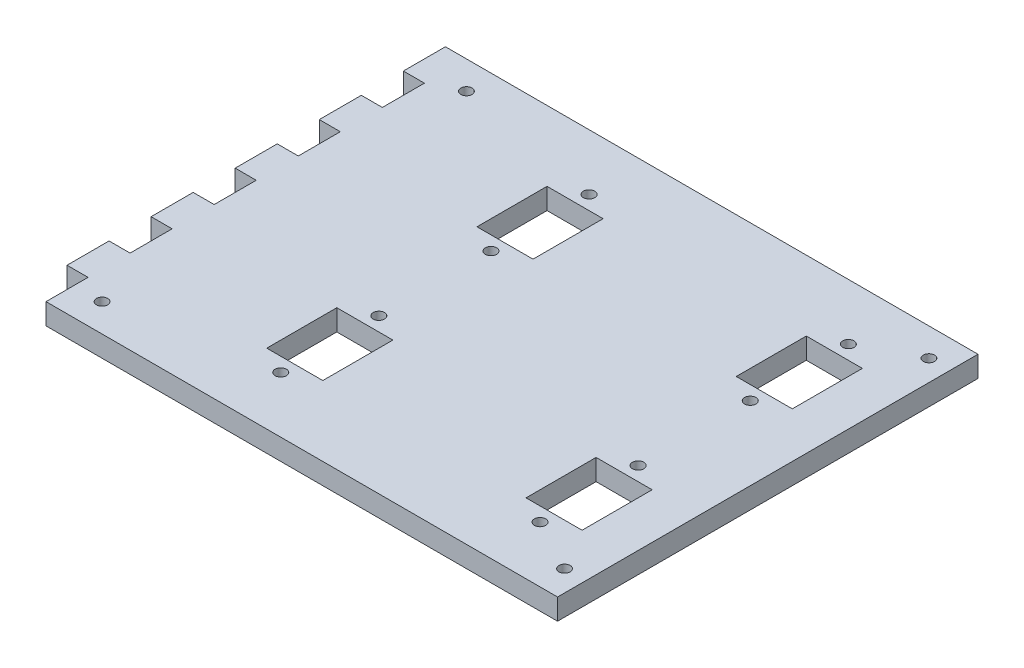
ISO-10303-21;
HEADER;
FILE_DESCRIPTION(('STEP AP214'),'2;1');
FILE_NAME('part.step','',(''),(''),'','','');
FILE_SCHEMA(('AUTOMOTIVE_DESIGN { 1 0 10303 214 1 1 1 1 }'));
ENDSEC;
DATA;
#1=APPLICATION_CONTEXT('core data for automotive mechanical design processes');
#2=APPLICATION_PROTOCOL_DEFINITION('international standard','automotive_design',2000,#1);
#3=PRODUCT_CONTEXT('',#1,'mechanical');
#4=PRODUCT('Part','Part','',(#3));
#5=PRODUCT_RELATED_PRODUCT_CATEGORY('part','',(#4));
#6=PRODUCT_DEFINITION_FORMATION('','',#4);
#7=PRODUCT_DEFINITION_CONTEXT('part definition',#1,'design');
#8=PRODUCT_DEFINITION('design','',#6,#7);
#9=PRODUCT_DEFINITION_SHAPE('','',#8);
#10=(LENGTH_UNIT() NAMED_UNIT(*) SI_UNIT(.MILLI.,.METRE.));
#11=(NAMED_UNIT(*) PLANE_ANGLE_UNIT() SI_UNIT($,.RADIAN.));
#12=(NAMED_UNIT(*) SI_UNIT($,.STERADIAN.) SOLID_ANGLE_UNIT());
#13=UNCERTAINTY_MEASURE_WITH_UNIT(LENGTH_MEASURE(1.E-05),#10,'distance_accuracy_value','');
#14=(GEOMETRIC_REPRESENTATION_CONTEXT(3) GLOBAL_UNCERTAINTY_ASSIGNED_CONTEXT((#13)) GLOBAL_UNIT_ASSIGNED_CONTEXT((#10,
#11,#12)) REPRESENTATION_CONTEXT('',''));
#15=CARTESIAN_POINT('',(0.,0.,0.));
#16=DIRECTION('',(0.,0.,1.));
#17=DIRECTION('',(1.,0.,0.));
#18=AXIS2_PLACEMENT_3D('',#15,#16,#17);
#19=CARTESIAN_POINT('',(0.,15.,0.));
#20=DIRECTION('',(1.,0.,0.));
#21=DIRECTION('',(0.,0.,-1.));
#22=AXIS2_PLACEMENT_3D('',#19,#20,#21);
#23=PLANE('',#22);
#24=DIRECTION('',(0.,0.,1.));
#25=VECTOR('',#24,1.);
#26=CARTESIAN_POINT('',(0.,0.,0.));
#27=LINE('',#26,#25);
#28=CARTESIAN_POINT('',(0.,0.,60.));
#29=VERTEX_POINT('',#28);
#30=CARTESIAN_POINT('',(0.,0.,90.));
#31=VERTEX_POINT('',#30);
#32=EDGE_CURVE('E557',#29,#31,#27,.T.);
#33=ORIENTED_EDGE('',*,*,#32,.T.);
#34=DIRECTION('',(0.,1.,0.));
#35=VECTOR('',#34,1.);
#36=CARTESIAN_POINT('',(0.,0.,90.));
#37=LINE('',#36,#35);
#38=CARTESIAN_POINT('',(0.,15.,90.));
#39=VERTEX_POINT('',#38);
#40=EDGE_CURVE('E438',#31,#39,#37,.T.);
#41=ORIENTED_EDGE('',*,*,#40,.T.);
#42=DIRECTION('',(0.,0.,1.));
#43=VECTOR('',#42,1.);
#44=CARTESIAN_POINT('',(0.,15.,0.));
#45=LINE('',#44,#43);
#46=CARTESIAN_POINT('',(0.,15.,60.));
#47=VERTEX_POINT('',#46);
#48=EDGE_CURVE('E545',#47,#39,#45,.T.);
#49=ORIENTED_EDGE('',*,*,#48,.F.);
#50=DIRECTION('',(0.,1.,0.));
#51=VECTOR('',#50,1.);
#52=CARTESIAN_POINT('',(0.,0.,60.));
#53=LINE('',#52,#51);
#54=EDGE_CURVE('E525',#29,#47,#53,.T.);
#55=ORIENTED_EDGE('',*,*,#54,.F.);
#56=EDGE_LOOP('',(#33,#41,#49,#55));
#57=FACE_BOUND('',#56,.T.);
#58=ADVANCED_FACE('F34',(#57),#23,.F.);
#59=CARTESIAN_POINT('',(0.,15.,120.));
#60=VERTEX_POINT('',#59);
#61=CARTESIAN_POINT('',(0.,15.,150.));
#62=VERTEX_POINT('',#61);
#63=EDGE_CURVE('E609',#60,#62,#45,.T.);
#64=ORIENTED_EDGE('',*,*,#63,.F.);
#65=DIRECTION('',(0.,1.,0.));
#66=VECTOR('',#65,1.);
#67=CARTESIAN_POINT('',(0.,0.,120.));
#68=LINE('',#67,#66);
#69=CARTESIAN_POINT('',(0.,0.,120.));
#70=VERTEX_POINT('',#69);
#71=EDGE_CURVE('E429',#70,#60,#68,.T.);
#72=ORIENTED_EDGE('',*,*,#71,.F.);
#73=CARTESIAN_POINT('',(0.,0.,150.));
#74=VERTEX_POINT('',#73);
#75=EDGE_CURVE('E638',#70,#74,#27,.T.);
#76=ORIENTED_EDGE('',*,*,#75,.T.);
#77=DIRECTION('',(0.,1.,0.));
#78=VECTOR('',#77,1.);
#79=CARTESIAN_POINT('',(0.,0.,150.));
#80=LINE('',#79,#78);
#81=EDGE_CURVE('E434',#74,#62,#80,.T.);
#82=ORIENTED_EDGE('',*,*,#81,.T.);
#83=EDGE_LOOP('',(#64,#72,#76,#82));
#84=FACE_BOUND('',#83,.T.);
#85=ADVANCED_FACE('F636',(#84),#23,.F.);
#86=CARTESIAN_POINT('',(0.,15.,180.));
#87=VERTEX_POINT('',#86);
#88=CARTESIAN_POINT('',(0.,15.,210.));
#89=VERTEX_POINT('',#88);
#90=EDGE_CURVE('E607',#87,#89,#45,.T.);
#91=ORIENTED_EDGE('',*,*,#90,.F.);
#92=DIRECTION('',(0.,1.,0.));
#93=VECTOR('',#92,1.);
#94=CARTESIAN_POINT('',(0.,0.,180.));
#95=LINE('',#94,#93);
#96=CARTESIAN_POINT('',(0.,0.,180.));
#97=VERTEX_POINT('',#96);
#98=EDGE_CURVE('E457',#97,#87,#95,.T.);
#99=ORIENTED_EDGE('',*,*,#98,.F.);
#100=CARTESIAN_POINT('',(0.,0.,210.));
#101=VERTEX_POINT('',#100);
#102=EDGE_CURVE('E653',#97,#101,#27,.T.);
#103=ORIENTED_EDGE('',*,*,#102,.T.);
#104=DIRECTION('',(0.,1.,0.));
#105=VECTOR('',#104,1.);
#106=CARTESIAN_POINT('',(0.,0.,210.));
#107=LINE('',#106,#105);
#108=EDGE_CURVE('E462',#101,#89,#107,.T.);
#109=ORIENTED_EDGE('',*,*,#108,.T.);
#110=EDGE_LOOP('',(#91,#99,#103,#109));
#111=FACE_BOUND('',#110,.T.);
#112=ADVANCED_FACE('F651',(#111),#23,.F.);
#113=CARTESIAN_POINT('',(0.,0.,0.));
#114=VERTEX_POINT('',#113);
#115=CARTESIAN_POINT('',(0.,0.,30.));
#116=VERTEX_POINT('',#115);
#117=EDGE_CURVE('E553',#114,#116,#27,.T.);
#118=ORIENTED_EDGE('',*,*,#117,.T.);
#119=DIRECTION('',(0.,1.,0.));
#120=VECTOR('',#119,1.);
#121=CARTESIAN_POINT('',(0.,0.,30.));
#122=LINE('',#121,#120);
#123=CARTESIAN_POINT('',(0.,15.,30.));
#124=VERTEX_POINT('',#123);
#125=EDGE_CURVE('E532',#116,#124,#122,.T.);
#126=ORIENTED_EDGE('',*,*,#125,.T.);
#127=CARTESIAN_POINT('',(0.,15.,0.));
#128=VERTEX_POINT('',#127);
#129=EDGE_CURVE('E541',#128,#124,#45,.T.);
#130=ORIENTED_EDGE('',*,*,#129,.F.);
#131=DIRECTION('',(0.,-1.,0.));
#132=VECTOR('',#131,1.);
#133=CARTESIAN_POINT('',(0.,15.,0.));
#134=LINE('',#133,#132);
#135=EDGE_CURVE('E552',#128,#114,#134,.T.);
#136=ORIENTED_EDGE('',*,*,#135,.T.);
#137=EDGE_LOOP('',(#118,#126,#130,#136));
#138=FACE_BOUND('',#137,.T.);
#139=ADVANCED_FACE('F580',(#138),#23,.F.);
#140=CARTESIAN_POINT('',(0.,15.,240.));
#141=VERTEX_POINT('',#140);
#142=CARTESIAN_POINT('',(0.,15.,270.));
#143=VERTEX_POINT('',#142);
#144=EDGE_CURVE('E546',#141,#143,#45,.T.);
#145=ORIENTED_EDGE('',*,*,#144,.F.);
#146=DIRECTION('',(0.,1.,0.));
#147=VECTOR('',#146,1.);
#148=CARTESIAN_POINT('',(0.,0.,240.));
#149=LINE('',#148,#147);
#150=CARTESIAN_POINT('',(0.,0.,240.));
#151=VERTEX_POINT('',#150);
#152=EDGE_CURVE('E483',#151,#141,#149,.T.);
#153=ORIENTED_EDGE('',*,*,#152,.F.);
#154=CARTESIAN_POINT('',(0.,0.,270.));
#155=VERTEX_POINT('',#154);
#156=EDGE_CURVE('E535',#151,#155,#27,.T.);
#157=ORIENTED_EDGE('',*,*,#156,.T.);
#158=DIRECTION('',(0.,1.,0.));
#159=VECTOR('',#158,1.);
#160=CARTESIAN_POINT('',(0.,0.,270.));
#161=LINE('',#160,#159);
#162=EDGE_CURVE('E488',#155,#143,#161,.T.);
#163=ORIENTED_EDGE('',*,*,#162,.T.);
#164=EDGE_LOOP('',(#145,#153,#157,#163));
#165=FACE_BOUND('',#164,.T.);
#166=ADVANCED_FACE('F36',(#165),#23,.F.);
#167=CARTESIAN_POINT('',(0.,15.,300.));
#168=DIRECTION('',(0.,0.,-1.));
#169=DIRECTION('',(-1.,0.,0.));
#170=AXIS2_PLACEMENT_3D('',#167,#168,#169);
#171=PLANE('',#170);
#172=DIRECTION('',(1.,0.,0.));
#173=VECTOR('',#172,1.);
#174=CARTESIAN_POINT('',(0.,15.,300.));
#175=LINE('',#174,#173);
#176=CARTESIAN_POINT('',(15.,15.,300.));
#177=VERTEX_POINT('',#176);
#178=CARTESIAN_POINT('',(380.,15.,300.));
#179=VERTEX_POINT('',#178);
#180=EDGE_CURVE('E544',#177,#179,#175,.T.);
#181=ORIENTED_EDGE('',*,*,#180,.F.);
#182=DIRECTION('',(0.,1.,0.));
#183=VECTOR('',#182,1.);
#184=CARTESIAN_POINT('',(15.,0.,300.));
#185=LINE('',#184,#183);
#186=CARTESIAN_POINT('',(15.,0.,300.));
#187=VERTEX_POINT('',#186);
#188=EDGE_CURVE('E506',#187,#177,#185,.T.);
#189=ORIENTED_EDGE('',*,*,#188,.F.);
#190=DIRECTION('',(1.,0.,0.));
#191=VECTOR('',#190,1.);
#192=CARTESIAN_POINT('',(0.,0.,300.));
#193=LINE('',#192,#191);
#194=CARTESIAN_POINT('',(380.,0.,300.));
#195=VERTEX_POINT('',#194);
#196=EDGE_CURVE('E556',#187,#195,#193,.T.);
#197=ORIENTED_EDGE('',*,*,#196,.T.);
#198=DIRECTION('',(0.,-1.,0.));
#199=VECTOR('',#198,1.);
#200=CARTESIAN_POINT('',(380.,15.,300.));
#201=LINE('',#200,#199);
#202=EDGE_CURVE('E11',#179,#195,#201,.T.);
#203=ORIENTED_EDGE('',*,*,#202,.F.);
#204=EDGE_LOOP('',(#181,#189,#197,#203));
#205=FACE_BOUND('',#204,.T.);
#206=ADVANCED_FACE('F591',(#205),#171,.F.);
#207=CARTESIAN_POINT('',(380.,15.,0.));
#208=DIRECTION('',(-1.,0.,0.));
#209=DIRECTION('',(0.,0.,1.));
#210=AXIS2_PLACEMENT_3D('',#207,#208,#209);
#211=PLANE('',#210);
#212=DIRECTION('',(0.,0.,-1.));
#213=VECTOR('',#212,1.);
#214=CARTESIAN_POINT('',(380.,0.,0.));
#215=LINE('',#214,#213);
#216=CARTESIAN_POINT('',(380.,0.,0.));
#217=VERTEX_POINT('',#216);
#218=EDGE_CURVE('E559',#195,#217,#215,.T.);
#219=ORIENTED_EDGE('',*,*,#218,.T.);
#220=DIRECTION('',(0.,-1.,0.));
#221=VECTOR('',#220,1.);
#222=CARTESIAN_POINT('',(380.,15.,0.));
#223=LINE('',#222,#221);
#224=CARTESIAN_POINT('',(380.,15.,0.));
#225=VERTEX_POINT('',#224);
#226=EDGE_CURVE('E42',#225,#217,#223,.T.);
#227=ORIENTED_EDGE('',*,*,#226,.F.);
#228=DIRECTION('',(0.,0.,-1.));
#229=VECTOR('',#228,1.);
#230=CARTESIAN_POINT('',(380.,15.,0.));
#231=LINE('',#230,#229);
#232=EDGE_CURVE('E548',#179,#225,#231,.T.);
#233=ORIENTED_EDGE('',*,*,#232,.F.);
#234=ORIENTED_EDGE('',*,*,#202,.T.);
#235=EDGE_LOOP('',(#219,#227,#233,#234));
#236=FACE_BOUND('',#235,.T.);
#237=ADVANCED_FACE('F589',(#236),#211,.F.);
#238=CARTESIAN_POINT('',(0.,15.,0.));
#239=DIRECTION('',(0.,0.,1.));
#240=DIRECTION('',(1.,0.,0.));
#241=AXIS2_PLACEMENT_3D('',#238,#239,#240);
#242=PLANE('',#241);
#243=DIRECTION('',(-1.,0.,0.));
#244=VECTOR('',#243,1.);
#245=CARTESIAN_POINT('',(0.,0.,0.));
#246=LINE('',#245,#244);
#247=EDGE_CURVE('E561',#217,#114,#246,.T.);
#248=ORIENTED_EDGE('',*,*,#247,.T.);
#249=ORIENTED_EDGE('',*,*,#135,.F.);
#250=DIRECTION('',(-1.,0.,0.));
#251=VECTOR('',#250,1.);
#252=CARTESIAN_POINT('',(0.,15.,0.));
#253=LINE('',#252,#251);
#254=EDGE_CURVE('E550',#225,#128,#253,.T.);
#255=ORIENTED_EDGE('',*,*,#254,.F.);
#256=ORIENTED_EDGE('',*,*,#226,.T.);
#257=EDGE_LOOP('',(#248,#249,#255,#256));
#258=FACE_BOUND('',#257,.T.);
#259=ADVANCED_FACE('F569',(#258),#242,.F.);
#260=CARTESIAN_POINT('',(0.,15.,0.));
#261=DIRECTION('',(0.,1.,0.));
#262=DIRECTION('',(0.,0.,1.));
#263=AXIS2_PLACEMENT_3D('',#260,#261,#262);
#264=PLANE('',#263);
#265=CARTESIAN_POINT('',(327.5,15.,110.));
#266=DIRECTION('',(0.,1.,0.));
#267=DIRECTION('',(0.,0.,1.));
#268=AXIS2_PLACEMENT_3D('',#265,#266,#267);
#269=CIRCLE('',#268,4.05000000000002);
#270=CARTESIAN_POINT('',(327.5,15.,114.05));
#271=VERTEX_POINT('',#270);
#272=EDGE_CURVE('E1132',#271,#271,#269,.T.);
#273=ORIENTED_EDGE('',*,*,#272,.F.);
#274=EDGE_LOOP('',(#273));
#275=FACE_BOUND('',#274,.T.);
#276=CARTESIAN_POINT('',(327.5,15.,190.));
#277=DIRECTION('',(0.,1.,0.));
#278=DIRECTION('',(0.,0.,1.));
#279=AXIS2_PLACEMENT_3D('',#276,#277,#278);
#280=CIRCLE('',#279,4.05000000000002);
#281=CARTESIAN_POINT('',(327.5,15.,194.05));
#282=VERTEX_POINT('',#281);
#283=EDGE_CURVE('E1138',#282,#282,#280,.T.);
#284=ORIENTED_EDGE('',*,*,#283,.F.);
#285=EDGE_LOOP('',(#284));
#286=FACE_BOUND('',#285,.T.);
#287=CARTESIAN_POINT('',(327.5,15.,260.));
#288=DIRECTION('',(0.,1.,0.));
#289=DIRECTION('',(0.,0.,1.));
#290=AXIS2_PLACEMENT_3D('',#287,#288,#289);
#291=CIRCLE('',#290,4.05000000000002);
#292=CARTESIAN_POINT('',(327.5,15.,264.05));
#293=VERTEX_POINT('',#292);
#294=EDGE_CURVE('E1147',#293,#293,#291,.T.);
#295=ORIENTED_EDGE('',*,*,#294,.F.);
#296=EDGE_LOOP('',(#295));
#297=FACE_BOUND('',#296,.T.);
#298=CARTESIAN_POINT('',(142.5,15.,260.));
#299=DIRECTION('',(0.,1.,0.));
#300=DIRECTION('',(0.,0.,1.));
#301=AXIS2_PLACEMENT_3D('',#298,#299,#300);
#302=CIRCLE('',#301,4.05);
#303=CARTESIAN_POINT('',(142.5,15.,264.05));
#304=VERTEX_POINT('',#303);
#305=EDGE_CURVE('E1153',#304,#304,#302,.T.);
#306=ORIENTED_EDGE('',*,*,#305,.F.);
#307=EDGE_LOOP('',(#306));
#308=FACE_BOUND('',#307,.T.);
#309=CARTESIAN_POINT('',(142.5,15.,110.));
#310=DIRECTION('',(0.,1.,0.));
#311=DIRECTION('',(0.,0.,1.));
#312=AXIS2_PLACEMENT_3D('',#309,#310,#311);
#313=CIRCLE('',#312,4.04999999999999);
#314=CARTESIAN_POINT('',(142.5,15.,114.05));
#315=VERTEX_POINT('',#314);
#316=EDGE_CURVE('E1247',#315,#315,#313,.T.);
#317=ORIENTED_EDGE('',*,*,#316,.F.);
#318=EDGE_LOOP('',(#317));
#319=FACE_BOUND('',#318,.T.);
#320=CARTESIAN_POINT('',(142.5,15.,40.));
#321=DIRECTION('',(0.,1.,0.));
#322=DIRECTION('',(0.,0.,1.));
#323=AXIS2_PLACEMENT_3D('',#320,#321,#322);
#324=CIRCLE('',#323,4.04999999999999);
#325=CARTESIAN_POINT('',(142.5,15.,44.05));
#326=VERTEX_POINT('',#325);
#327=EDGE_CURVE('E1251',#326,#326,#324,.T.);
#328=ORIENTED_EDGE('',*,*,#327,.F.);
#329=EDGE_LOOP('',(#328));
#330=FACE_BOUND('',#329,.T.);
#331=CARTESIAN_POINT('',(142.5,15.,190.));
#332=DIRECTION('',(0.,1.,0.));
#333=DIRECTION('',(0.,0.,1.));
#334=AXIS2_PLACEMENT_3D('',#331,#332,#333);
#335=CIRCLE('',#334,4.04999999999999);
#336=CARTESIAN_POINT('',(142.5,15.,194.05));
#337=VERTEX_POINT('',#336);
#338=EDGE_CURVE('E1239',#337,#337,#335,.T.);
#339=ORIENTED_EDGE('',*,*,#338,.F.);
#340=EDGE_LOOP('',(#339));
#341=FACE_BOUND('',#340,.T.);
#342=CARTESIAN_POINT('',(327.5,15.,40.));
#343=DIRECTION('',(0.,1.,0.));
#344=DIRECTION('',(0.,0.,1.));
#345=AXIS2_PLACEMENT_3D('',#342,#343,#344);
#346=CIRCLE('',#345,4.05000000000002);
#347=CARTESIAN_POINT('',(327.5,15.,44.05));
#348=VERTEX_POINT('',#347);
#349=EDGE_CURVE('E1135',#348,#348,#346,.T.);
#350=ORIENTED_EDGE('',*,*,#349,.F.);
#351=EDGE_LOOP('',(#350));
#352=FACE_BOUND('',#351,.T.);
#353=CARTESIAN_POINT('',(365.,15.,20.));
#354=DIRECTION('',(0.,1.,0.));
#355=DIRECTION('',(0.,0.,1.));
#356=AXIS2_PLACEMENT_3D('',#353,#354,#355);
#357=CIRCLE('',#356,3.99999999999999);
#358=CARTESIAN_POINT('',(365.,15.,24.));
#359=VERTEX_POINT('',#358);
#360=EDGE_CURVE('E1172',#359,#359,#357,.T.);
#361=ORIENTED_EDGE('',*,*,#360,.F.);
#362=EDGE_LOOP('',(#361));
#363=FACE_BOUND('',#362,.T.);
#364=CARTESIAN_POINT('',(35.,15.,280.));
#365=DIRECTION('',(0.,1.,0.));
#366=DIRECTION('',(0.,0.,1.));
#367=AXIS2_PLACEMENT_3D('',#364,#365,#366);
#368=CIRCLE('',#367,4.00000000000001);
#369=CARTESIAN_POINT('',(35.,15.,284.));
#370=VERTEX_POINT('',#369);
#371=EDGE_CURVE('E1166',#370,#370,#368,.T.);
#372=ORIENTED_EDGE('',*,*,#371,.F.);
#373=EDGE_LOOP('',(#372));
#374=FACE_BOUND('',#373,.T.);
#375=CARTESIAN_POINT('',(35.,15.,20.));
#376=DIRECTION('',(0.,1.,0.));
#377=DIRECTION('',(0.,0.,1.));
#378=AXIS2_PLACEMENT_3D('',#375,#376,#377);
#379=CIRCLE('',#378,4.00000000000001);
#380=CARTESIAN_POINT('',(35.,15.,24.));
#381=VERTEX_POINT('',#380);
#382=EDGE_CURVE('E1160',#381,#381,#379,.T.);
#383=ORIENTED_EDGE('',*,*,#382,.F.);
#384=EDGE_LOOP('',(#383));
#385=FACE_BOUND('',#384,.T.);
#386=CARTESIAN_POINT('',(365.,15.,280.));
#387=DIRECTION('',(0.,1.,0.));
#388=DIRECTION('',(0.,0.,1.));
#389=AXIS2_PLACEMENT_3D('',#386,#387,#388);
#390=CIRCLE('',#389,3.99999999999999);
#391=CARTESIAN_POINT('',(365.,15.,284.));
#392=VERTEX_POINT('',#391);
#393=EDGE_CURVE('E310',#392,#392,#390,.T.);
#394=ORIENTED_EDGE('',*,*,#393,.F.);
#395=EDGE_LOOP('',(#394));
#396=FACE_BOUND('',#395,.T.);
#397=DIRECTION('',(0.,0.,1.));
#398=VECTOR('',#397,1.);
#399=CARTESIAN_POINT('',(347.5,15.,200.));
#400=LINE('',#399,#398);
#401=CARTESIAN_POINT('',(347.5,15.,200.));
#402=VERTEX_POINT('',#401);
#403=CARTESIAN_POINT('',(347.5,15.,250.));
#404=VERTEX_POINT('',#403);
#405=EDGE_CURVE('E327',#402,#404,#400,.T.);
#406=ORIENTED_EDGE('',*,*,#405,.T.);
#407=DIRECTION('',(-1.,0.,0.));
#408=VECTOR('',#407,1.);
#409=CARTESIAN_POINT('',(347.5,15.,250.));
#410=LINE('',#409,#408);
#411=CARTESIAN_POINT('',(307.5,15.,250.));
#412=VERTEX_POINT('',#411);
#413=EDGE_CURVE('E330',#404,#412,#410,.T.);
#414=ORIENTED_EDGE('',*,*,#413,.T.);
#415=DIRECTION('',(0.,0.,-1.));
#416=VECTOR('',#415,1.);
#417=CARTESIAN_POINT('',(307.5,15.,200.));
#418=LINE('',#417,#416);
#419=CARTESIAN_POINT('',(307.5,15.,200.));
#420=VERTEX_POINT('',#419);
#421=EDGE_CURVE('E49',#412,#420,#418,.T.);
#422=ORIENTED_EDGE('',*,*,#421,.T.);
#423=DIRECTION('',(1.,0.,0.));
#424=VECTOR('',#423,1.);
#425=CARTESIAN_POINT('',(347.5,15.,200.));
#426=LINE('',#425,#424);
#427=EDGE_CURVE('E335',#420,#402,#426,.T.);
#428=ORIENTED_EDGE('',*,*,#427,.T.);
#429=EDGE_LOOP('',(#406,#414,#422,#428));
#430=FACE_BOUND('',#429,.T.);
#431=DIRECTION('',(0.,0.,1.));
#432=VECTOR('',#431,1.);
#433=CARTESIAN_POINT('',(162.5,15.,50.));
#434=LINE('',#433,#432);
#435=CARTESIAN_POINT('',(162.5,15.,50.));
#436=VERTEX_POINT('',#435);
#437=CARTESIAN_POINT('',(162.5,15.,100.));
#438=VERTEX_POINT('',#437);
#439=EDGE_CURVE('E359',#436,#438,#434,.T.);
#440=ORIENTED_EDGE('',*,*,#439,.T.);
#441=DIRECTION('',(-1.,0.,0.));
#442=VECTOR('',#441,1.);
#443=CARTESIAN_POINT('',(162.5,15.,100.));
#444=LINE('',#443,#442);
#445=CARTESIAN_POINT('',(122.5,15.,100.));
#446=VERTEX_POINT('',#445);
#447=EDGE_CURVE('E362',#438,#446,#444,.T.);
#448=ORIENTED_EDGE('',*,*,#447,.T.);
#449=DIRECTION('',(0.,0.,-1.));
#450=VECTOR('',#449,1.);
#451=CARTESIAN_POINT('',(122.5,15.,50.));
#452=LINE('',#451,#450);
#453=CARTESIAN_POINT('',(122.5,15.,50.));
#454=VERTEX_POINT('',#453);
#455=EDGE_CURVE('E57',#446,#454,#452,.T.);
#456=ORIENTED_EDGE('',*,*,#455,.T.);
#457=DIRECTION('',(1.,0.,0.));
#458=VECTOR('',#457,1.);
#459=CARTESIAN_POINT('',(162.5,15.,50.));
#460=LINE('',#459,#458);
#461=EDGE_CURVE('E367',#454,#436,#460,.T.);
#462=ORIENTED_EDGE('',*,*,#461,.T.);
#463=EDGE_LOOP('',(#440,#448,#456,#462));
#464=FACE_BOUND('',#463,.T.);
#465=DIRECTION('',(0.,0.,1.));
#466=VECTOR('',#465,1.);
#467=CARTESIAN_POINT('',(162.5,15.,200.));
#468=LINE('',#467,#466);
#469=CARTESIAN_POINT('',(162.5,15.,200.));
#470=VERTEX_POINT('',#469);
#471=CARTESIAN_POINT('',(162.5,15.,250.));
#472=VERTEX_POINT('',#471);
#473=EDGE_CURVE('E283',#470,#472,#468,.T.);
#474=ORIENTED_EDGE('',*,*,#473,.T.);
#475=DIRECTION('',(-1.,0.,0.));
#476=VECTOR('',#475,1.);
#477=CARTESIAN_POINT('',(162.5,15.,250.));
#478=LINE('',#477,#476);
#479=CARTESIAN_POINT('',(122.5,15.,250.));
#480=VERTEX_POINT('',#479);
#481=EDGE_CURVE('E295',#472,#480,#478,.T.);
#482=ORIENTED_EDGE('',*,*,#481,.T.);
#483=DIRECTION('',(0.,0.,-1.));
#484=VECTOR('',#483,1.);
#485=CARTESIAN_POINT('',(122.5,15.,200.));
#486=LINE('',#485,#484);
#487=CARTESIAN_POINT('',(122.5,15.,200.));
#488=VERTEX_POINT('',#487);
#489=EDGE_CURVE('E299',#480,#488,#486,.T.);
#490=ORIENTED_EDGE('',*,*,#489,.T.);
#491=DIRECTION('',(1.,0.,0.));
#492=VECTOR('',#491,1.);
#493=CARTESIAN_POINT('',(162.5,15.,200.));
#494=LINE('',#493,#492);
#495=EDGE_CURVE('E291',#488,#470,#494,.T.);
#496=ORIENTED_EDGE('',*,*,#495,.T.);
#497=EDGE_LOOP('',(#474,#482,#490,#496));
#498=FACE_BOUND('',#497,.T.);
#499=DIRECTION('',(0.,0.,1.));
#500=VECTOR('',#499,1.);
#501=CARTESIAN_POINT('',(347.5,15.,50.));
#502=LINE('',#501,#500);
#503=CARTESIAN_POINT('',(347.5,15.,50.));
#504=VERTEX_POINT('',#503);
#505=CARTESIAN_POINT('',(347.5,15.,100.));
#506=VERTEX_POINT('',#505);
#507=EDGE_CURVE('E387',#504,#506,#502,.T.);
#508=ORIENTED_EDGE('',*,*,#507,.T.);
#509=DIRECTION('',(-1.,0.,0.));
#510=VECTOR('',#509,1.);
#511=CARTESIAN_POINT('',(347.5,15.,100.));
#512=LINE('',#511,#510);
#513=CARTESIAN_POINT('',(307.5,15.,100.));
#514=VERTEX_POINT('',#513);
#515=EDGE_CURVE('E390',#506,#514,#512,.T.);
#516=ORIENTED_EDGE('',*,*,#515,.T.);
#517=DIRECTION('',(0.,0.,-1.));
#518=VECTOR('',#517,1.);
#519=CARTESIAN_POINT('',(307.5,15.,50.));
#520=LINE('',#519,#518);
#521=CARTESIAN_POINT('',(307.5,15.,50.));
#522=VERTEX_POINT('',#521);
#523=EDGE_CURVE('E394',#514,#522,#520,.T.);
#524=ORIENTED_EDGE('',*,*,#523,.T.);
#525=DIRECTION('',(1.,0.,0.));
#526=VECTOR('',#525,1.);
#527=CARTESIAN_POINT('',(347.5,15.,50.));
#528=LINE('',#527,#526);
#529=EDGE_CURVE('E397',#522,#504,#528,.T.);
#530=ORIENTED_EDGE('',*,*,#529,.T.);
#531=EDGE_LOOP('',(#508,#516,#524,#530));
#532=FACE_BOUND('',#531,.T.);
#533=DIRECTION('',(-1.,0.,0.));
#534=VECTOR('',#533,1.);
#535=CARTESIAN_POINT('',(0.,15.,90.));
#536=LINE('',#535,#534);
#537=CARTESIAN_POINT('',(15.,15.,90.));
#538=VERTEX_POINT('',#537);
#539=EDGE_CURVE('E423',#538,#39,#536,.T.);
#540=ORIENTED_EDGE('',*,*,#539,.F.);
#541=DIRECTION('',(0.,0.,-1.));
#542=VECTOR('',#541,1.);
#543=CARTESIAN_POINT('',(15.,15.,90.));
#544=LINE('',#543,#542);
#545=CARTESIAN_POINT('',(15.,15.,120.));
#546=VERTEX_POINT('',#545);
#547=EDGE_CURVE('E433',#546,#538,#544,.T.);
#548=ORIENTED_EDGE('',*,*,#547,.F.);
#549=DIRECTION('',(1.,0.,0.));
#550=VECTOR('',#549,1.);
#551=CARTESIAN_POINT('',(15.,15.,120.));
#552=LINE('',#551,#550);
#553=EDGE_CURVE('E430',#60,#546,#552,.T.);
#554=ORIENTED_EDGE('',*,*,#553,.F.);
#555=ORIENTED_EDGE('',*,*,#63,.T.);
#556=DIRECTION('',(-1.,0.,0.));
#557=VECTOR('',#556,1.);
#558=CARTESIAN_POINT('',(0.,15.,150.));
#559=LINE('',#558,#557);
#560=CARTESIAN_POINT('',(15.,15.,150.));
#561=VERTEX_POINT('',#560);
#562=EDGE_CURVE('E451',#561,#62,#559,.T.);
#563=ORIENTED_EDGE('',*,*,#562,.F.);
#564=DIRECTION('',(0.,0.,-1.));
#565=VECTOR('',#564,1.);
#566=CARTESIAN_POINT('',(15.,15.,150.));
#567=LINE('',#566,#565);
#568=CARTESIAN_POINT('',(15.,15.,180.));
#569=VERTEX_POINT('',#568);
#570=EDGE_CURVE('E461',#569,#561,#567,.T.);
#571=ORIENTED_EDGE('',*,*,#570,.F.);
#572=DIRECTION('',(1.,0.,0.));
#573=VECTOR('',#572,1.);
#574=CARTESIAN_POINT('',(15.,15.,180.));
#575=LINE('',#574,#573);
#576=EDGE_CURVE('E458',#87,#569,#575,.T.);
#577=ORIENTED_EDGE('',*,*,#576,.F.);
#578=ORIENTED_EDGE('',*,*,#90,.T.);
#579=DIRECTION('',(-1.,0.,0.));
#580=VECTOR('',#579,1.);
#581=CARTESIAN_POINT('',(0.,15.,210.));
#582=LINE('',#581,#580);
#583=CARTESIAN_POINT('',(15.,15.,210.));
#584=VERTEX_POINT('',#583);
#585=EDGE_CURVE('E477',#584,#89,#582,.T.);
#586=ORIENTED_EDGE('',*,*,#585,.F.);
#587=DIRECTION('',(0.,0.,-1.));
#588=VECTOR('',#587,1.);
#589=CARTESIAN_POINT('',(15.,15.,210.));
#590=LINE('',#589,#588);
#591=CARTESIAN_POINT('',(15.,15.,240.));
#592=VERTEX_POINT('',#591);
#593=EDGE_CURVE('E487',#592,#584,#590,.T.);
#594=ORIENTED_EDGE('',*,*,#593,.F.);
#595=DIRECTION('',(1.,0.,0.));
#596=VECTOR('',#595,1.);
#597=CARTESIAN_POINT('',(15.,15.,240.));
#598=LINE('',#597,#596);
#599=EDGE_CURVE('E484',#141,#592,#598,.T.);
#600=ORIENTED_EDGE('',*,*,#599,.F.);
#601=ORIENTED_EDGE('',*,*,#144,.T.);
#602=DIRECTION('',(-1.,0.,0.));
#603=VECTOR('',#602,1.);
#604=CARTESIAN_POINT('',(0.,15.,270.));
#605=LINE('',#604,#603);
#606=CARTESIAN_POINT('',(15.,15.,270.));
#607=VERTEX_POINT('',#606);
#608=EDGE_CURVE('E503',#607,#143,#605,.T.);
#609=ORIENTED_EDGE('',*,*,#608,.F.);
#610=DIRECTION('',(0.,0.,-1.));
#611=VECTOR('',#610,1.);
#612=CARTESIAN_POINT('',(15.,15.,270.));
#613=LINE('',#612,#611);
#614=EDGE_CURVE('E412',#177,#607,#613,.T.);
#615=ORIENTED_EDGE('',*,*,#614,.F.);
#616=ORIENTED_EDGE('',*,*,#180,.T.);
#617=ORIENTED_EDGE('',*,*,#232,.T.);
#618=ORIENTED_EDGE('',*,*,#254,.T.);
#619=ORIENTED_EDGE('',*,*,#129,.T.);
#620=DIRECTION('',(-1.,0.,0.));
#621=VECTOR('',#620,1.);
#622=CARTESIAN_POINT('',(0.,15.,30.));
#623=LINE('',#622,#621);
#624=CARTESIAN_POINT('',(15.,15.,30.));
#625=VERTEX_POINT('',#624);
#626=EDGE_CURVE('E519',#625,#124,#623,.T.);
#627=ORIENTED_EDGE('',*,*,#626,.F.);
#628=DIRECTION('',(0.,0.,-1.));
#629=VECTOR('',#628,1.);
#630=CARTESIAN_POINT('',(15.,15.,30.));
#631=LINE('',#630,#629);
#632=CARTESIAN_POINT('',(15.,15.,60.));
#633=VERTEX_POINT('',#632);
#634=EDGE_CURVE('E528',#633,#625,#631,.T.);
#635=ORIENTED_EDGE('',*,*,#634,.F.);
#636=DIRECTION('',(1.,0.,0.));
#637=VECTOR('',#636,1.);
#638=CARTESIAN_POINT('',(15.,15.,60.));
#639=LINE('',#638,#637);
#640=EDGE_CURVE('E441',#47,#633,#639,.T.);
#641=ORIENTED_EDGE('',*,*,#640,.F.);
#642=ORIENTED_EDGE('',*,*,#48,.T.);
#643=EDGE_LOOP('',(#540,#548,#554,#555,#563,#571,#577,#578,#586,#594,#600,#601,#609,#615,#616,
#617,#618,#619,#627,#635,#641,#642));
#644=FACE_BOUND('',#643,.T.);
#645=ADVANCED_FACE('F301',(#275,#286,#297,#308,#319,#330,#341,#352,#363,#374,#385,#396,#430,
#464,#498,#532,#644),#264,.T.);
#646=CARTESIAN_POINT('',(0.,0.,0.));
#647=DIRECTION('',(0.,1.,0.));
#648=DIRECTION('',(0.,0.,1.));
#649=AXIS2_PLACEMENT_3D('',#646,#647,#648);
#650=PLANE('',#649);
#651=CARTESIAN_POINT('',(327.5,0.,110.));
#652=DIRECTION('',(0.,1.,0.));
#653=DIRECTION('',(0.,0.,1.));
#654=AXIS2_PLACEMENT_3D('',#651,#652,#653);
#655=CIRCLE('',#654,4.05000000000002);
#656=CARTESIAN_POINT('',(327.5,0.,114.05));
#657=VERTEX_POINT('',#656);
#658=EDGE_CURVE('E1129',#657,#657,#655,.T.);
#659=ORIENTED_EDGE('',*,*,#658,.T.);
#660=EDGE_LOOP('',(#659));
#661=FACE_BOUND('',#660,.T.);
#662=CARTESIAN_POINT('',(327.5,0.,190.));
#663=DIRECTION('',(0.,1.,0.));
#664=DIRECTION('',(0.,0.,1.));
#665=AXIS2_PLACEMENT_3D('',#662,#663,#664);
#666=CIRCLE('',#665,4.05000000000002);
#667=CARTESIAN_POINT('',(327.5,0.,194.05));
#668=VERTEX_POINT('',#667);
#669=EDGE_CURVE('E1133',#668,#668,#666,.T.);
#670=ORIENTED_EDGE('',*,*,#669,.T.);
#671=EDGE_LOOP('',(#670));
#672=FACE_BOUND('',#671,.T.);
#673=CARTESIAN_POINT('',(327.5,0.,260.));
#674=DIRECTION('',(0.,1.,0.));
#675=DIRECTION('',(0.,0.,1.));
#676=AXIS2_PLACEMENT_3D('',#673,#674,#675);
#677=CIRCLE('',#676,4.05000000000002);
#678=CARTESIAN_POINT('',(327.5,0.,264.05));
#679=VERTEX_POINT('',#678);
#680=EDGE_CURVE('E1144',#679,#679,#677,.T.);
#681=ORIENTED_EDGE('',*,*,#680,.T.);
#682=EDGE_LOOP('',(#681));
#683=FACE_BOUND('',#682,.T.);
#684=CARTESIAN_POINT('',(142.5,0.,260.));
#685=DIRECTION('',(0.,1.,0.));
#686=DIRECTION('',(0.,0.,1.));
#687=AXIS2_PLACEMENT_3D('',#684,#685,#686);
#688=CIRCLE('',#687,4.05);
#689=CARTESIAN_POINT('',(142.5,0.,264.05));
#690=VERTEX_POINT('',#689);
#691=EDGE_CURVE('E1150',#690,#690,#688,.T.);
#692=ORIENTED_EDGE('',*,*,#691,.T.);
#693=EDGE_LOOP('',(#692));
#694=FACE_BOUND('',#693,.T.);
#695=CARTESIAN_POINT('',(142.5,0.,110.));
#696=DIRECTION('',(0.,1.,0.));
#697=DIRECTION('',(0.,0.,1.));
#698=AXIS2_PLACEMENT_3D('',#695,#696,#697);
#699=CIRCLE('',#698,4.04999999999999);
#700=CARTESIAN_POINT('',(142.5,0.,114.05));
#701=VERTEX_POINT('',#700);
#702=EDGE_CURVE('E1253',#701,#701,#699,.T.);
#703=ORIENTED_EDGE('',*,*,#702,.T.);
#704=EDGE_LOOP('',(#703));
#705=FACE_BOUND('',#704,.T.);
#706=CARTESIAN_POINT('',(142.5,0.,40.));
#707=DIRECTION('',(0.,1.,0.));
#708=DIRECTION('',(0.,0.,1.));
#709=AXIS2_PLACEMENT_3D('',#706,#707,#708);
#710=CIRCLE('',#709,4.04999999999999);
#711=CARTESIAN_POINT('',(142.5,0.,44.05));
#712=VERTEX_POINT('',#711);
#713=EDGE_CURVE('E1244',#712,#712,#710,.T.);
#714=ORIENTED_EDGE('',*,*,#713,.T.);
#715=EDGE_LOOP('',(#714));
#716=FACE_BOUND('',#715,.T.);
#717=CARTESIAN_POINT('',(142.5,0.,190.));
#718=DIRECTION('',(0.,1.,0.));
#719=DIRECTION('',(0.,0.,1.));
#720=AXIS2_PLACEMENT_3D('',#717,#718,#719);
#721=CIRCLE('',#720,4.04999999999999);
#722=CARTESIAN_POINT('',(142.5,0.,194.05));
#723=VERTEX_POINT('',#722);
#724=EDGE_CURVE('E1156',#723,#723,#721,.T.);
#725=ORIENTED_EDGE('',*,*,#724,.T.);
#726=EDGE_LOOP('',(#725));
#727=FACE_BOUND('',#726,.T.);
#728=CARTESIAN_POINT('',(327.5,0.,40.));
#729=DIRECTION('',(0.,1.,0.));
#730=DIRECTION('',(0.,0.,1.));
#731=AXIS2_PLACEMENT_3D('',#728,#729,#730);
#732=CIRCLE('',#731,4.05000000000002);
#733=CARTESIAN_POINT('',(327.5,0.,44.05));
#734=VERTEX_POINT('',#733);
#735=EDGE_CURVE('E1157',#734,#734,#732,.T.);
#736=ORIENTED_EDGE('',*,*,#735,.T.);
#737=EDGE_LOOP('',(#736));
#738=FACE_BOUND('',#737,.T.);
#739=CARTESIAN_POINT('',(365.,0.,20.));
#740=DIRECTION('',(0.,1.,0.));
#741=DIRECTION('',(0.,0.,1.));
#742=AXIS2_PLACEMENT_3D('',#739,#740,#741);
#743=CIRCLE('',#742,3.99999999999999);
#744=CARTESIAN_POINT('',(365.,0.,24.));
#745=VERTEX_POINT('',#744);
#746=EDGE_CURVE('E1169',#745,#745,#743,.T.);
#747=ORIENTED_EDGE('',*,*,#746,.T.);
#748=EDGE_LOOP('',(#747));
#749=FACE_BOUND('',#748,.T.);
#750=CARTESIAN_POINT('',(35.,0.,280.));
#751=DIRECTION('',(0.,1.,0.));
#752=DIRECTION('',(0.,0.,1.));
#753=AXIS2_PLACEMENT_3D('',#750,#751,#752);
#754=CIRCLE('',#753,4.00000000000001);
#755=CARTESIAN_POINT('',(35.,0.,284.));
#756=VERTEX_POINT('',#755);
#757=EDGE_CURVE('E1175',#756,#756,#754,.T.);
#758=ORIENTED_EDGE('',*,*,#757,.T.);
#759=EDGE_LOOP('',(#758));
#760=FACE_BOUND('',#759,.T.);
#761=CARTESIAN_POINT('',(35.,0.,20.));
#762=DIRECTION('',(0.,1.,0.));
#763=DIRECTION('',(0.,0.,1.));
#764=AXIS2_PLACEMENT_3D('',#761,#762,#763);
#765=CIRCLE('',#764,4.00000000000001);
#766=CARTESIAN_POINT('',(35.,0.,24.));
#767=VERTEX_POINT('',#766);
#768=EDGE_CURVE('E1163',#767,#767,#765,.T.);
#769=ORIENTED_EDGE('',*,*,#768,.T.);
#770=EDGE_LOOP('',(#769));
#771=FACE_BOUND('',#770,.T.);
#772=CARTESIAN_POINT('',(365.,0.,280.));
#773=DIRECTION('',(0.,1.,0.));
#774=DIRECTION('',(0.,0.,1.));
#775=AXIS2_PLACEMENT_3D('',#772,#773,#774);
#776=CIRCLE('',#775,3.99999999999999);
#777=CARTESIAN_POINT('',(365.,0.,284.));
#778=VERTEX_POINT('',#777);
#779=EDGE_CURVE('E317',#778,#778,#776,.T.);
#780=ORIENTED_EDGE('',*,*,#779,.T.);
#781=EDGE_LOOP('',(#780));
#782=FACE_BOUND('',#781,.T.);
#783=DIRECTION('',(-1.,0.,0.));
#784=VECTOR('',#783,1.);
#785=CARTESIAN_POINT('',(347.5,0.,250.));
#786=LINE('',#785,#784);
#787=CARTESIAN_POINT('',(347.5,0.,250.));
#788=VERTEX_POINT('',#787);
#789=CARTESIAN_POINT('',(307.5,0.,250.));
#790=VERTEX_POINT('',#789);
#791=EDGE_CURVE('E341',#788,#790,#786,.T.);
#792=ORIENTED_EDGE('',*,*,#791,.F.);
#793=DIRECTION('',(0.,0.,1.));
#794=VECTOR('',#793,1.);
#795=CARTESIAN_POINT('',(347.5,0.,200.));
#796=LINE('',#795,#794);
#797=CARTESIAN_POINT('',(347.5,0.,200.));
#798=VERTEX_POINT('',#797);
#799=EDGE_CURVE('E339',#798,#788,#796,.T.);
#800=ORIENTED_EDGE('',*,*,#799,.F.);
#801=DIRECTION('',(1.,0.,0.));
#802=VECTOR('',#801,1.);
#803=CARTESIAN_POINT('',(347.5,0.,200.));
#804=LINE('',#803,#802);
#805=CARTESIAN_POINT('',(307.5,0.,200.));
#806=VERTEX_POINT('',#805);
#807=EDGE_CURVE('E331',#806,#798,#804,.T.);
#808=ORIENTED_EDGE('',*,*,#807,.F.);
#809=DIRECTION('',(0.,0.,-1.));
#810=VECTOR('',#809,1.);
#811=CARTESIAN_POINT('',(307.5,0.,200.));
#812=LINE('',#811,#810);
#813=EDGE_CURVE('E345',#790,#806,#812,.T.);
#814=ORIENTED_EDGE('',*,*,#813,.F.);
#815=EDGE_LOOP('',(#792,#800,#808,#814));
#816=FACE_BOUND('',#815,.T.);
#817=DIRECTION('',(-1.,0.,0.));
#818=VECTOR('',#817,1.);
#819=CARTESIAN_POINT('',(162.5,0.,100.));
#820=LINE('',#819,#818);
#821=CARTESIAN_POINT('',(162.5,0.,100.));
#822=VERTEX_POINT('',#821);
#823=CARTESIAN_POINT('',(122.5,0.,100.));
#824=VERTEX_POINT('',#823);
#825=EDGE_CURVE('E372',#822,#824,#820,.T.);
#826=ORIENTED_EDGE('',*,*,#825,.F.);
#827=DIRECTION('',(0.,0.,1.));
#828=VECTOR('',#827,1.);
#829=CARTESIAN_POINT('',(162.5,0.,50.));
#830=LINE('',#829,#828);
#831=CARTESIAN_POINT('',(162.5,0.,50.));
#832=VERTEX_POINT('',#831);
#833=EDGE_CURVE('E323',#832,#822,#830,.T.);
#834=ORIENTED_EDGE('',*,*,#833,.F.);
#835=DIRECTION('',(1.,0.,0.));
#836=VECTOR('',#835,1.);
#837=CARTESIAN_POINT('',(162.5,0.,50.));
#838=LINE('',#837,#836);
#839=CARTESIAN_POINT('',(122.5,0.,50.));
#840=VERTEX_POINT('',#839);
#841=EDGE_CURVE('E363',#840,#832,#838,.T.);
#842=ORIENTED_EDGE('',*,*,#841,.F.);
#843=DIRECTION('',(0.,0.,-1.));
#844=VECTOR('',#843,1.);
#845=CARTESIAN_POINT('',(122.5,0.,50.));
#846=LINE('',#845,#844);
#847=EDGE_CURVE('E375',#824,#840,#846,.T.);
#848=ORIENTED_EDGE('',*,*,#847,.F.);
#849=EDGE_LOOP('',(#826,#834,#842,#848));
#850=FACE_BOUND('',#849,.T.);
#851=DIRECTION('',(-1.,0.,0.));
#852=VECTOR('',#851,1.);
#853=CARTESIAN_POINT('',(162.5,0.,250.));
#854=LINE('',#853,#852);
#855=CARTESIAN_POINT('',(162.5,0.,250.));
#856=VERTEX_POINT('',#855);
#857=CARTESIAN_POINT('',(122.5,0.,250.));
#858=VERTEX_POINT('',#857);
#859=EDGE_CURVE('E316',#856,#858,#854,.T.);
#860=ORIENTED_EDGE('',*,*,#859,.F.);
#861=DIRECTION('',(0.,0.,1.));
#862=VECTOR('',#861,1.);
#863=CARTESIAN_POINT('',(162.5,0.,200.));
#864=LINE('',#863,#862);
#865=CARTESIAN_POINT('',(162.5,0.,200.));
#866=VERTEX_POINT('',#865);
#867=EDGE_CURVE('E286',#866,#856,#864,.T.);
#868=ORIENTED_EDGE('',*,*,#867,.F.);
#869=DIRECTION('',(1.,0.,0.));
#870=VECTOR('',#869,1.);
#871=CARTESIAN_POINT('',(162.5,0.,200.));
#872=LINE('',#871,#870);
#873=CARTESIAN_POINT('',(122.5,0.,200.));
#874=VERTEX_POINT('',#873);
#875=EDGE_CURVE('E304',#874,#866,#872,.T.);
#876=ORIENTED_EDGE('',*,*,#875,.F.);
#877=DIRECTION('',(0.,0.,-1.));
#878=VECTOR('',#877,1.);
#879=CARTESIAN_POINT('',(122.5,0.,200.));
#880=LINE('',#879,#878);
#881=EDGE_CURVE('E307',#858,#874,#880,.T.);
#882=ORIENTED_EDGE('',*,*,#881,.F.);
#883=EDGE_LOOP('',(#860,#868,#876,#882));
#884=FACE_BOUND('',#883,.T.);
#885=DIRECTION('',(-1.,0.,0.));
#886=VECTOR('',#885,1.);
#887=CARTESIAN_POINT('',(347.5,0.,100.));
#888=LINE('',#887,#886);
#889=CARTESIAN_POINT('',(347.5,0.,100.));
#890=VERTEX_POINT('',#889);
#891=CARTESIAN_POINT('',(307.5,0.,100.));
#892=VERTEX_POINT('',#891);
#893=EDGE_CURVE('E402',#890,#892,#888,.T.);
#894=ORIENTED_EDGE('',*,*,#893,.F.);
#895=DIRECTION('',(0.,0.,1.));
#896=VECTOR('',#895,1.);
#897=CARTESIAN_POINT('',(347.5,0.,50.));
#898=LINE('',#897,#896);
#899=CARTESIAN_POINT('',(347.5,0.,50.));
#900=VERTEX_POINT('',#899);
#901=EDGE_CURVE('E352',#900,#890,#898,.T.);
#902=ORIENTED_EDGE('',*,*,#901,.F.);
#903=DIRECTION('',(1.,0.,0.));
#904=VECTOR('',#903,1.);
#905=CARTESIAN_POINT('',(347.5,0.,50.));
#906=LINE('',#905,#904);
#907=CARTESIAN_POINT('',(307.5,0.,50.));
#908=VERTEX_POINT('',#907);
#909=EDGE_CURVE('E391',#908,#900,#906,.T.);
#910=ORIENTED_EDGE('',*,*,#909,.F.);
#911=DIRECTION('',(0.,0.,-1.));
#912=VECTOR('',#911,1.);
#913=CARTESIAN_POINT('',(307.5,0.,50.));
#914=LINE('',#913,#912);
#915=EDGE_CURVE('E405',#892,#908,#914,.T.);
#916=ORIENTED_EDGE('',*,*,#915,.F.);
#917=EDGE_LOOP('',(#894,#902,#910,#916));
#918=FACE_BOUND('',#917,.T.);
#919=DIRECTION('',(0.,0.,-1.));
#920=VECTOR('',#919,1.);
#921=CARTESIAN_POINT('',(15.,0.,90.));
#922=LINE('',#921,#920);
#923=CARTESIAN_POINT('',(15.,0.,120.));
#924=VERTEX_POINT('',#923);
#925=CARTESIAN_POINT('',(15.,0.,90.));
#926=VERTEX_POINT('',#925);
#927=EDGE_CURVE('E422',#924,#926,#922,.T.);
#928=ORIENTED_EDGE('',*,*,#927,.T.);
#929=DIRECTION('',(-1.,0.,0.));
#930=VECTOR('',#929,1.);
#931=CARTESIAN_POINT('',(0.,0.,90.));
#932=LINE('',#931,#930);
#933=EDGE_CURVE('E426',#926,#31,#932,.T.);
#934=ORIENTED_EDGE('',*,*,#933,.T.);
#935=ORIENTED_EDGE('',*,*,#32,.F.);
#936=DIRECTION('',(1.,0.,0.));
#937=VECTOR('',#936,1.);
#938=CARTESIAN_POINT('',(15.,0.,60.));
#939=LINE('',#938,#937);
#940=CARTESIAN_POINT('',(15.,0.,60.));
#941=VERTEX_POINT('',#940);
#942=EDGE_CURVE('E515',#29,#941,#939,.T.);
#943=ORIENTED_EDGE('',*,*,#942,.T.);
#944=DIRECTION('',(0.,0.,-1.));
#945=VECTOR('',#944,1.);
#946=CARTESIAN_POINT('',(15.,0.,30.));
#947=LINE('',#946,#945);
#948=CARTESIAN_POINT('',(15.,0.,30.));
#949=VERTEX_POINT('',#948);
#950=EDGE_CURVE('E518',#941,#949,#947,.T.);
#951=ORIENTED_EDGE('',*,*,#950,.T.);
#952=DIRECTION('',(-1.,0.,0.));
#953=VECTOR('',#952,1.);
#954=CARTESIAN_POINT('',(0.,0.,30.));
#955=LINE('',#954,#953);
#956=EDGE_CURVE('E522',#949,#116,#955,.T.);
#957=ORIENTED_EDGE('',*,*,#956,.T.);
#958=ORIENTED_EDGE('',*,*,#117,.F.);
#959=ORIENTED_EDGE('',*,*,#247,.F.);
#960=ORIENTED_EDGE('',*,*,#218,.F.);
#961=ORIENTED_EDGE('',*,*,#196,.F.);
#962=DIRECTION('',(0.,0.,-1.));
#963=VECTOR('',#962,1.);
#964=CARTESIAN_POINT('',(15.,0.,270.));
#965=LINE('',#964,#963);
#966=CARTESIAN_POINT('',(15.,0.,270.));
#967=VERTEX_POINT('',#966);
#968=EDGE_CURVE('E499',#187,#967,#965,.T.);
#969=ORIENTED_EDGE('',*,*,#968,.T.);
#970=DIRECTION('',(-1.,0.,0.));
#971=VECTOR('',#970,1.);
#972=CARTESIAN_POINT('',(0.,0.,270.));
#973=LINE('',#972,#971);
#974=EDGE_CURVE('E502',#967,#155,#973,.T.);
#975=ORIENTED_EDGE('',*,*,#974,.T.);
#976=ORIENTED_EDGE('',*,*,#156,.F.);
#977=DIRECTION('',(1.,0.,0.));
#978=VECTOR('',#977,1.);
#979=CARTESIAN_POINT('',(15.,0.,240.));
#980=LINE('',#979,#978);
#981=CARTESIAN_POINT('',(15.,0.,240.));
#982=VERTEX_POINT('',#981);
#983=EDGE_CURVE('E473',#151,#982,#980,.T.);
#984=ORIENTED_EDGE('',*,*,#983,.T.);
#985=DIRECTION('',(0.,0.,-1.));
#986=VECTOR('',#985,1.);
#987=CARTESIAN_POINT('',(15.,0.,210.));
#988=LINE('',#987,#986);
#989=CARTESIAN_POINT('',(15.,0.,210.));
#990=VERTEX_POINT('',#989);
#991=EDGE_CURVE('E476',#982,#990,#988,.T.);
#992=ORIENTED_EDGE('',*,*,#991,.T.);
#993=DIRECTION('',(-1.,0.,0.));
#994=VECTOR('',#993,1.);
#995=CARTESIAN_POINT('',(0.,0.,210.));
#996=LINE('',#995,#994);
#997=EDGE_CURVE('E480',#990,#101,#996,.T.);
#998=ORIENTED_EDGE('',*,*,#997,.T.);
#999=ORIENTED_EDGE('',*,*,#102,.F.);
#1000=DIRECTION('',(1.,0.,0.));
#1001=VECTOR('',#1000,1.);
#1002=CARTESIAN_POINT('',(15.,0.,180.));
#1003=LINE('',#1002,#1001);
#1004=CARTESIAN_POINT('',(15.,0.,180.));
#1005=VERTEX_POINT('',#1004);
#1006=EDGE_CURVE('E447',#97,#1005,#1003,.T.);
#1007=ORIENTED_EDGE('',*,*,#1006,.T.);
#1008=DIRECTION('',(0.,0.,-1.));
#1009=VECTOR('',#1008,1.);
#1010=CARTESIAN_POINT('',(15.,0.,150.));
#1011=LINE('',#1010,#1009);
#1012=CARTESIAN_POINT('',(15.,0.,150.));
#1013=VERTEX_POINT('',#1012);
#1014=EDGE_CURVE('E450',#1005,#1013,#1011,.T.);
#1015=ORIENTED_EDGE('',*,*,#1014,.T.);
#1016=DIRECTION('',(-1.,0.,0.));
#1017=VECTOR('',#1016,1.);
#1018=CARTESIAN_POINT('',(0.,0.,150.));
#1019=LINE('',#1018,#1017);
#1020=EDGE_CURVE('E454',#1013,#74,#1019,.T.);
#1021=ORIENTED_EDGE('',*,*,#1020,.T.);
#1022=ORIENTED_EDGE('',*,*,#75,.F.);
#1023=DIRECTION('',(1.,0.,0.));
#1024=VECTOR('',#1023,1.);
#1025=CARTESIAN_POINT('',(15.,0.,120.));
#1026=LINE('',#1025,#1024);
#1027=EDGE_CURVE('E419',#70,#924,#1026,.T.);
#1028=ORIENTED_EDGE('',*,*,#1027,.T.);
#1029=EDGE_LOOP('',(#928,#934,#935,#943,#951,#957,#958,#959,#960,#961,#969,#975,#976,#984,#992,
#998,#999,#1007,#1015,#1021,#1022,#1028));
#1030=FACE_BOUND('',#1029,.T.);
#1031=ADVANCED_FACE('F576',(#661,#672,#683,#694,#705,#716,#727,#738,#749,#760,#771,#782,#816,
#850,#884,#918,#1030),#650,.F.);
#1032=CARTESIAN_POINT('',(0.,0.,30.));
#1033=DIRECTION('',(0.,0.,-1.));
#1034=DIRECTION('',(-1.,0.,0.));
#1035=AXIS2_PLACEMENT_3D('',#1032,#1033,#1034);
#1036=PLANE('',#1035);
#1037=ORIENTED_EDGE('',*,*,#626,.T.);
#1038=ORIENTED_EDGE('',*,*,#125,.F.);
#1039=ORIENTED_EDGE('',*,*,#956,.F.);
#1040=DIRECTION('',(0.,1.,0.));
#1041=VECTOR('',#1040,1.);
#1042=CARTESIAN_POINT('',(15.,0.,30.));
#1043=LINE('',#1042,#1041);
#1044=EDGE_CURVE('E536',#949,#625,#1043,.T.);
#1045=ORIENTED_EDGE('',*,*,#1044,.T.);
#1046=EDGE_LOOP('',(#1037,#1038,#1039,#1045));
#1047=FACE_BOUND('',#1046,.T.);
#1048=ADVANCED_FACE('F715',(#1047),#1036,.F.);
#1049=CARTESIAN_POINT('',(15.,0.,30.));
#1050=DIRECTION('',(1.,0.,0.));
#1051=DIRECTION('',(0.,0.,-1.));
#1052=AXIS2_PLACEMENT_3D('',#1049,#1050,#1051);
#1053=PLANE('',#1052);
#1054=ORIENTED_EDGE('',*,*,#634,.T.);
#1055=ORIENTED_EDGE('',*,*,#1044,.F.);
#1056=ORIENTED_EDGE('',*,*,#950,.F.);
#1057=DIRECTION('',(0.,1.,0.));
#1058=VECTOR('',#1057,1.);
#1059=CARTESIAN_POINT('',(15.,0.,60.));
#1060=LINE('',#1059,#1058);
#1061=EDGE_CURVE('E538',#941,#633,#1060,.T.);
#1062=ORIENTED_EDGE('',*,*,#1061,.T.);
#1063=EDGE_LOOP('',(#1054,#1055,#1056,#1062));
#1064=FACE_BOUND('',#1063,.T.);
#1065=ADVANCED_FACE('F704',(#1064),#1053,.F.);
#1066=CARTESIAN_POINT('',(15.,0.,60.));
#1067=DIRECTION('',(0.,0.,1.));
#1068=DIRECTION('',(1.,0.,0.));
#1069=AXIS2_PLACEMENT_3D('',#1066,#1067,#1068);
#1070=PLANE('',#1069);
#1071=ORIENTED_EDGE('',*,*,#640,.T.);
#1072=ORIENTED_EDGE('',*,*,#1061,.F.);
#1073=ORIENTED_EDGE('',*,*,#942,.F.);
#1074=ORIENTED_EDGE('',*,*,#54,.T.);
#1075=EDGE_LOOP('',(#1071,#1072,#1073,#1074));
#1076=FACE_BOUND('',#1075,.T.);
#1077=ADVANCED_FACE('F699',(#1076),#1070,.F.);
#1078=CARTESIAN_POINT('',(0.,0.,270.));
#1079=DIRECTION('',(0.,0.,-1.));
#1080=DIRECTION('',(-1.,0.,0.));
#1081=AXIS2_PLACEMENT_3D('',#1078,#1079,#1080);
#1082=PLANE('',#1081);
#1083=ORIENTED_EDGE('',*,*,#608,.T.);
#1084=ORIENTED_EDGE('',*,*,#162,.F.);
#1085=ORIENTED_EDGE('',*,*,#974,.F.);
#1086=DIRECTION('',(0.,1.,0.));
#1087=VECTOR('',#1086,1.);
#1088=CARTESIAN_POINT('',(15.,0.,270.));
#1089=LINE('',#1088,#1087);
#1090=EDGE_CURVE('E512',#967,#607,#1089,.T.);
#1091=ORIENTED_EDGE('',*,*,#1090,.T.);
#1092=EDGE_LOOP('',(#1083,#1084,#1085,#1091));
#1093=FACE_BOUND('',#1092,.T.);
#1094=ADVANCED_FACE('F600',(#1093),#1082,.F.);
#1095=CARTESIAN_POINT('',(15.,0.,270.));
#1096=DIRECTION('',(1.,0.,0.));
#1097=DIRECTION('',(0.,0.,-1.));
#1098=AXIS2_PLACEMENT_3D('',#1095,#1096,#1097);
#1099=PLANE('',#1098);
#1100=ORIENTED_EDGE('',*,*,#614,.T.);
#1101=ORIENTED_EDGE('',*,*,#1090,.F.);
#1102=ORIENTED_EDGE('',*,*,#968,.F.);
#1103=ORIENTED_EDGE('',*,*,#188,.T.);
#1104=EDGE_LOOP('',(#1100,#1101,#1102,#1103));
#1105=FACE_BOUND('',#1104,.T.);
#1106=ADVANCED_FACE('F597',(#1105),#1099,.F.);
#1107=CARTESIAN_POINT('',(0.,0.,210.));
#1108=DIRECTION('',(0.,0.,-1.));
#1109=DIRECTION('',(-1.,0.,0.));
#1110=AXIS2_PLACEMENT_3D('',#1107,#1108,#1109);
#1111=PLANE('',#1110);
#1112=ORIENTED_EDGE('',*,*,#585,.T.);
#1113=ORIENTED_EDGE('',*,*,#108,.F.);
#1114=ORIENTED_EDGE('',*,*,#997,.F.);
#1115=DIRECTION('',(0.,1.,0.));
#1116=VECTOR('',#1115,1.);
#1117=CARTESIAN_POINT('',(15.,0.,210.));
#1118=LINE('',#1117,#1116);
#1119=EDGE_CURVE('E494',#990,#584,#1118,.T.);
#1120=ORIENTED_EDGE('',*,*,#1119,.T.);
#1121=EDGE_LOOP('',(#1112,#1113,#1114,#1120));
#1122=FACE_BOUND('',#1121,.T.);
#1123=ADVANCED_FACE('F656',(#1122),#1111,.F.);
#1124=CARTESIAN_POINT('',(15.,0.,210.));
#1125=DIRECTION('',(1.,0.,0.));
#1126=DIRECTION('',(0.,0.,-1.));
#1127=AXIS2_PLACEMENT_3D('',#1124,#1125,#1126);
#1128=PLANE('',#1127);
#1129=ORIENTED_EDGE('',*,*,#593,.T.);
#1130=ORIENTED_EDGE('',*,*,#1119,.F.);
#1131=ORIENTED_EDGE('',*,*,#991,.F.);
#1132=DIRECTION('',(0.,1.,0.));
#1133=VECTOR('',#1132,1.);
#1134=CARTESIAN_POINT('',(15.,0.,240.));
#1135=LINE('',#1134,#1133);
#1136=EDGE_CURVE('E496',#982,#592,#1135,.T.);
#1137=ORIENTED_EDGE('',*,*,#1136,.T.);
#1138=EDGE_LOOP('',(#1129,#1130,#1131,#1137));
#1139=FACE_BOUND('',#1138,.T.);
#1140=ADVANCED_FACE('F659',(#1139),#1128,.F.);
#1141=CARTESIAN_POINT('',(15.,0.,240.));
#1142=DIRECTION('',(0.,0.,1.));
#1143=DIRECTION('',(1.,0.,0.));
#1144=AXIS2_PLACEMENT_3D('',#1141,#1142,#1143);
#1145=PLANE('',#1144);
#1146=ORIENTED_EDGE('',*,*,#599,.T.);
#1147=ORIENTED_EDGE('',*,*,#1136,.F.);
#1148=ORIENTED_EDGE('',*,*,#983,.F.);
#1149=ORIENTED_EDGE('',*,*,#152,.T.);
#1150=EDGE_LOOP('',(#1146,#1147,#1148,#1149));
#1151=FACE_BOUND('',#1150,.T.);
#1152=ADVANCED_FACE('F661',(#1151),#1145,.F.);
#1153=CARTESIAN_POINT('',(0.,0.,150.));
#1154=DIRECTION('',(0.,0.,-1.));
#1155=DIRECTION('',(-1.,0.,0.));
#1156=AXIS2_PLACEMENT_3D('',#1153,#1154,#1155);
#1157=PLANE('',#1156);
#1158=ORIENTED_EDGE('',*,*,#562,.T.);
#1159=ORIENTED_EDGE('',*,*,#81,.F.);
#1160=ORIENTED_EDGE('',*,*,#1020,.F.);
#1161=DIRECTION('',(0.,1.,0.));
#1162=VECTOR('',#1161,1.);
#1163=CARTESIAN_POINT('',(15.,0.,150.));
#1164=LINE('',#1163,#1162);
#1165=EDGE_CURVE('E468',#1013,#561,#1164,.T.);
#1166=ORIENTED_EDGE('',*,*,#1165,.T.);
#1167=EDGE_LOOP('',(#1158,#1159,#1160,#1166));
#1168=FACE_BOUND('',#1167,.T.);
#1169=ADVANCED_FACE('F641',(#1168),#1157,.F.);
#1170=CARTESIAN_POINT('',(15.,0.,150.));
#1171=DIRECTION('',(1.,0.,0.));
#1172=DIRECTION('',(0.,0.,-1.));
#1173=AXIS2_PLACEMENT_3D('',#1170,#1171,#1172);
#1174=PLANE('',#1173);
#1175=ORIENTED_EDGE('',*,*,#570,.T.);
#1176=ORIENTED_EDGE('',*,*,#1165,.F.);
#1177=ORIENTED_EDGE('',*,*,#1014,.F.);
#1178=DIRECTION('',(0.,1.,0.));
#1179=VECTOR('',#1178,1.);
#1180=CARTESIAN_POINT('',(15.,0.,180.));
#1181=LINE('',#1180,#1179);
#1182=EDGE_CURVE('E470',#1005,#569,#1181,.T.);
#1183=ORIENTED_EDGE('',*,*,#1182,.T.);
#1184=EDGE_LOOP('',(#1175,#1176,#1177,#1183));
#1185=FACE_BOUND('',#1184,.T.);
#1186=ADVANCED_FACE('F645',(#1185),#1174,.F.);
#1187=CARTESIAN_POINT('',(15.,0.,180.));
#1188=DIRECTION('',(0.,0.,1.));
#1189=DIRECTION('',(1.,0.,0.));
#1190=AXIS2_PLACEMENT_3D('',#1187,#1188,#1189);
#1191=PLANE('',#1190);
#1192=ORIENTED_EDGE('',*,*,#576,.T.);
#1193=ORIENTED_EDGE('',*,*,#1182,.F.);
#1194=ORIENTED_EDGE('',*,*,#1006,.F.);
#1195=ORIENTED_EDGE('',*,*,#98,.T.);
#1196=EDGE_LOOP('',(#1192,#1193,#1194,#1195));
#1197=FACE_BOUND('',#1196,.T.);
#1198=ADVANCED_FACE('F647',(#1197),#1191,.F.);
#1199=CARTESIAN_POINT('',(0.,0.,90.));
#1200=DIRECTION('',(0.,0.,-1.));
#1201=DIRECTION('',(-1.,0.,0.));
#1202=AXIS2_PLACEMENT_3D('',#1199,#1200,#1201);
#1203=PLANE('',#1202);
#1204=ORIENTED_EDGE('',*,*,#539,.T.);
#1205=ORIENTED_EDGE('',*,*,#40,.F.);
#1206=ORIENTED_EDGE('',*,*,#933,.F.);
#1207=DIRECTION('',(0.,1.,0.));
#1208=VECTOR('',#1207,1.);
#1209=CARTESIAN_POINT('',(15.,0.,90.));
#1210=LINE('',#1209,#1208);
#1211=EDGE_CURVE('E442',#926,#538,#1210,.T.);
#1212=ORIENTED_EDGE('',*,*,#1211,.T.);
#1213=EDGE_LOOP('',(#1204,#1205,#1206,#1212));
#1214=FACE_BOUND('',#1213,.T.);
#1215=ADVANCED_FACE('F627',(#1214),#1203,.F.);
#1216=CARTESIAN_POINT('',(15.,0.,90.));
#1217=DIRECTION('',(1.,0.,0.));
#1218=DIRECTION('',(0.,0.,-1.));
#1219=AXIS2_PLACEMENT_3D('',#1216,#1217,#1218);
#1220=PLANE('',#1219);
#1221=ORIENTED_EDGE('',*,*,#547,.T.);
#1222=ORIENTED_EDGE('',*,*,#1211,.F.);
#1223=ORIENTED_EDGE('',*,*,#927,.F.);
#1224=DIRECTION('',(0.,1.,0.));
#1225=VECTOR('',#1224,1.);
#1226=CARTESIAN_POINT('',(15.,0.,120.));
#1227=LINE('',#1226,#1225);
#1228=EDGE_CURVE('E444',#924,#546,#1227,.T.);
#1229=ORIENTED_EDGE('',*,*,#1228,.T.);
#1230=EDGE_LOOP('',(#1221,#1222,#1223,#1229));
#1231=FACE_BOUND('',#1230,.T.);
#1232=ADVANCED_FACE('F631',(#1231),#1220,.F.);
#1233=CARTESIAN_POINT('',(15.,0.,120.));
#1234=DIRECTION('',(0.,0.,1.));
#1235=DIRECTION('',(1.,0.,0.));
#1236=AXIS2_PLACEMENT_3D('',#1233,#1234,#1235);
#1237=PLANE('',#1236);
#1238=ORIENTED_EDGE('',*,*,#553,.T.);
#1239=ORIENTED_EDGE('',*,*,#1228,.F.);
#1240=ORIENTED_EDGE('',*,*,#1027,.F.);
#1241=ORIENTED_EDGE('',*,*,#71,.T.);
#1242=EDGE_LOOP('',(#1238,#1239,#1240,#1241));
#1243=FACE_BOUND('',#1242,.T.);
#1244=ADVANCED_FACE('F633',(#1243),#1237,.F.);
#1245=CARTESIAN_POINT('',(347.5,15.,50.));
#1246=DIRECTION('',(1.,0.,0.));
#1247=DIRECTION('',(0.,0.,-1.));
#1248=AXIS2_PLACEMENT_3D('',#1245,#1246,#1247);
#1249=PLANE('',#1248);
#1250=ORIENTED_EDGE('',*,*,#901,.T.);
#1251=DIRECTION('',(0.,-1.,0.));
#1252=VECTOR('',#1251,1.);
#1253=CARTESIAN_POINT('',(347.5,15.,100.));
#1254=LINE('',#1253,#1252);
#1255=EDGE_CURVE('E400',#506,#890,#1254,.T.);
#1256=ORIENTED_EDGE('',*,*,#1255,.F.);
#1257=ORIENTED_EDGE('',*,*,#507,.F.);
#1258=DIRECTION('',(0.,-1.,0.));
#1259=VECTOR('',#1258,1.);
#1260=CARTESIAN_POINT('',(347.5,15.,50.));
#1261=LINE('',#1260,#1259);
#1262=EDGE_CURVE('E410',#504,#900,#1261,.T.);
#1263=ORIENTED_EDGE('',*,*,#1262,.T.);
#1264=EDGE_LOOP('',(#1250,#1256,#1257,#1263));
#1265=FACE_BOUND('',#1264,.T.);
#1266=ADVANCED_FACE('F835',(#1265),#1249,.F.);
#1267=CARTESIAN_POINT('',(347.5,15.,50.));
#1268=DIRECTION('',(0.,0.,-1.));
#1269=DIRECTION('',(-1.,0.,0.));
#1270=AXIS2_PLACEMENT_3D('',#1267,#1268,#1269);
#1271=PLANE('',#1270);
#1272=ORIENTED_EDGE('',*,*,#909,.T.);
#1273=ORIENTED_EDGE('',*,*,#1262,.F.);
#1274=ORIENTED_EDGE('',*,*,#529,.F.);
#1275=DIRECTION('',(0.,-1.,0.));
#1276=VECTOR('',#1275,1.);
#1277=CARTESIAN_POINT('',(307.5,15.,50.));
#1278=LINE('',#1277,#1276);
#1279=EDGE_CURVE('E413',#522,#908,#1278,.T.);
#1280=ORIENTED_EDGE('',*,*,#1279,.T.);
#1281=EDGE_LOOP('',(#1272,#1273,#1274,#1280));
#1282=FACE_BOUND('',#1281,.T.);
#1283=ADVANCED_FACE('F844',(#1282),#1271,.F.);
#1284=CARTESIAN_POINT('',(307.5,15.,50.));
#1285=DIRECTION('',(-1.,0.,0.));
#1286=DIRECTION('',(0.,0.,1.));
#1287=AXIS2_PLACEMENT_3D('',#1284,#1285,#1286);
#1288=PLANE('',#1287);
#1289=ORIENTED_EDGE('',*,*,#915,.T.);
#1290=ORIENTED_EDGE('',*,*,#1279,.F.);
#1291=ORIENTED_EDGE('',*,*,#523,.F.);
#1292=DIRECTION('',(0.,-1.,0.));
#1293=VECTOR('',#1292,1.);
#1294=CARTESIAN_POINT('',(307.5,15.,100.));
#1295=LINE('',#1294,#1293);
#1296=EDGE_CURVE('E415',#514,#892,#1295,.T.);
#1297=ORIENTED_EDGE('',*,*,#1296,.T.);
#1298=EDGE_LOOP('',(#1289,#1290,#1291,#1297));
#1299=FACE_BOUND('',#1298,.T.);
#1300=ADVANCED_FACE('F854',(#1299),#1288,.F.);
#1301=CARTESIAN_POINT('',(347.5,15.,100.));
#1302=DIRECTION('',(0.,0.,1.));
#1303=DIRECTION('',(1.,0.,0.));
#1304=AXIS2_PLACEMENT_3D('',#1301,#1302,#1303);
#1305=PLANE('',#1304);
#1306=ORIENTED_EDGE('',*,*,#893,.T.);
#1307=ORIENTED_EDGE('',*,*,#1296,.F.);
#1308=ORIENTED_EDGE('',*,*,#515,.F.);
#1309=ORIENTED_EDGE('',*,*,#1255,.T.);
#1310=EDGE_LOOP('',(#1306,#1307,#1308,#1309));
#1311=FACE_BOUND('',#1310,.T.);
#1312=ADVANCED_FACE('F864',(#1311),#1305,.F.);
#1313=CARTESIAN_POINT('',(162.5,15.,200.));
#1314=DIRECTION('',(1.,0.,0.));
#1315=DIRECTION('',(0.,0.,-1.));
#1316=AXIS2_PLACEMENT_3D('',#1313,#1314,#1315);
#1317=PLANE('',#1316);
#1318=ORIENTED_EDGE('',*,*,#867,.T.);
#1319=DIRECTION('',(0.,-1.,0.));
#1320=VECTOR('',#1319,1.);
#1321=CARTESIAN_POINT('',(162.5,15.,250.));
#1322=LINE('',#1321,#1320);
#1323=EDGE_CURVE('E279',#472,#856,#1322,.T.);
#1324=ORIENTED_EDGE('',*,*,#1323,.F.);
#1325=ORIENTED_EDGE('',*,*,#473,.F.);
#1326=DIRECTION('',(0.,-1.,0.));
#1327=VECTOR('',#1326,1.);
#1328=CARTESIAN_POINT('',(162.5,15.,200.));
#1329=LINE('',#1328,#1327);
#1330=EDGE_CURVE('E321',#470,#866,#1329,.T.);
#1331=ORIENTED_EDGE('',*,*,#1330,.T.);
#1332=EDGE_LOOP('',(#1318,#1324,#1325,#1331));
#1333=FACE_BOUND('',#1332,.T.);
#1334=ADVANCED_FACE('F281',(#1333),#1317,.F.);
#1335=CARTESIAN_POINT('',(162.5,15.,200.));
#1336=DIRECTION('',(0.,0.,-1.));
#1337=DIRECTION('',(-1.,0.,0.));
#1338=AXIS2_PLACEMENT_3D('',#1335,#1336,#1337);
#1339=PLANE('',#1338);
#1340=ORIENTED_EDGE('',*,*,#875,.T.);
#1341=ORIENTED_EDGE('',*,*,#1330,.F.);
#1342=ORIENTED_EDGE('',*,*,#495,.F.);
#1343=DIRECTION('',(0.,-1.,0.));
#1344=VECTOR('',#1343,1.);
#1345=CARTESIAN_POINT('',(122.5,15.,200.));
#1346=LINE('',#1345,#1344);
#1347=EDGE_CURVE('E324',#488,#874,#1346,.T.);
#1348=ORIENTED_EDGE('',*,*,#1347,.T.);
#1349=EDGE_LOOP('',(#1340,#1341,#1342,#1348));
#1350=FACE_BOUND('',#1349,.T.);
#1351=ADVANCED_FACE('F883',(#1350),#1339,.F.);
#1352=CARTESIAN_POINT('',(122.5,15.,200.));
#1353=DIRECTION('',(-1.,0.,0.));
#1354=DIRECTION('',(0.,0.,1.));
#1355=AXIS2_PLACEMENT_3D('',#1352,#1353,#1354);
#1356=PLANE('',#1355);
#1357=ORIENTED_EDGE('',*,*,#881,.T.);
#1358=ORIENTED_EDGE('',*,*,#1347,.F.);
#1359=ORIENTED_EDGE('',*,*,#489,.F.);
#1360=DIRECTION('',(0.,-1.,0.));
#1361=VECTOR('',#1360,1.);
#1362=CARTESIAN_POINT('',(122.5,15.,250.));
#1363=LINE('',#1362,#1361);
#1364=EDGE_CURVE('E290',#480,#858,#1363,.T.);
#1365=ORIENTED_EDGE('',*,*,#1364,.T.);
#1366=EDGE_LOOP('',(#1357,#1358,#1359,#1365));
#1367=FACE_BOUND('',#1366,.T.);
#1368=ADVANCED_FACE('F892',(#1367),#1356,.F.);
#1369=CARTESIAN_POINT('',(162.5,15.,250.));
#1370=DIRECTION('',(0.,0.,1.));
#1371=DIRECTION('',(1.,0.,0.));
#1372=AXIS2_PLACEMENT_3D('',#1369,#1370,#1371);
#1373=PLANE('',#1372);
#1374=ORIENTED_EDGE('',*,*,#859,.T.);
#1375=ORIENTED_EDGE('',*,*,#1364,.F.);
#1376=ORIENTED_EDGE('',*,*,#481,.F.);
#1377=ORIENTED_EDGE('',*,*,#1323,.T.);
#1378=EDGE_LOOP('',(#1374,#1375,#1376,#1377));
#1379=FACE_BOUND('',#1378,.T.);
#1380=ADVANCED_FACE('F296',(#1379),#1373,.F.);
#1381=CARTESIAN_POINT('',(162.5,15.,50.));
#1382=DIRECTION('',(1.,0.,0.));
#1383=DIRECTION('',(0.,0.,-1.));
#1384=AXIS2_PLACEMENT_3D('',#1381,#1382,#1383);
#1385=PLANE('',#1384);
#1386=ORIENTED_EDGE('',*,*,#833,.T.);
#1387=DIRECTION('',(0.,-1.,0.));
#1388=VECTOR('',#1387,1.);
#1389=CARTESIAN_POINT('',(162.5,15.,100.));
#1390=LINE('',#1389,#1388);
#1391=EDGE_CURVE('E370',#438,#822,#1390,.T.);
#1392=ORIENTED_EDGE('',*,*,#1391,.F.);
#1393=ORIENTED_EDGE('',*,*,#439,.F.);
#1394=DIRECTION('',(0.,-1.,0.));
#1395=VECTOR('',#1394,1.);
#1396=CARTESIAN_POINT('',(162.5,15.,50.));
#1397=LINE('',#1396,#1395);
#1398=EDGE_CURVE('E342',#436,#832,#1397,.T.);
#1399=ORIENTED_EDGE('',*,*,#1398,.T.);
#1400=EDGE_LOOP('',(#1386,#1392,#1393,#1399));
#1401=FACE_BOUND('',#1400,.T.);
#1402=ADVANCED_FACE('F911',(#1401),#1385,.F.);
#1403=CARTESIAN_POINT('',(162.5,15.,50.));
#1404=DIRECTION('',(0.,0.,-1.));
#1405=DIRECTION('',(-1.,0.,0.));
#1406=AXIS2_PLACEMENT_3D('',#1403,#1404,#1405);
#1407=PLANE('',#1406);
#1408=ORIENTED_EDGE('',*,*,#841,.T.);
#1409=ORIENTED_EDGE('',*,*,#1398,.F.);
#1410=ORIENTED_EDGE('',*,*,#461,.F.);
#1411=DIRECTION('',(0.,-1.,0.));
#1412=VECTOR('',#1411,1.);
#1413=CARTESIAN_POINT('',(122.5,15.,50.));
#1414=LINE('',#1413,#1412);
#1415=EDGE_CURVE('E381',#454,#840,#1414,.T.);
#1416=ORIENTED_EDGE('',*,*,#1415,.T.);
#1417=EDGE_LOOP('',(#1408,#1409,#1410,#1416));
#1418=FACE_BOUND('',#1417,.T.);
#1419=ADVANCED_FACE('F920',(#1418),#1407,.F.);
#1420=CARTESIAN_POINT('',(122.5,15.,50.));
#1421=DIRECTION('',(-1.,0.,0.));
#1422=DIRECTION('',(0.,0.,1.));
#1423=AXIS2_PLACEMENT_3D('',#1420,#1421,#1422);
#1424=PLANE('',#1423);
#1425=ORIENTED_EDGE('',*,*,#847,.T.);
#1426=ORIENTED_EDGE('',*,*,#1415,.F.);
#1427=ORIENTED_EDGE('',*,*,#455,.F.);
#1428=DIRECTION('',(0.,-1.,0.));
#1429=VECTOR('',#1428,1.);
#1430=CARTESIAN_POINT('',(122.5,15.,100.));
#1431=LINE('',#1430,#1429);
#1432=EDGE_CURVE('E383',#446,#824,#1431,.T.);
#1433=ORIENTED_EDGE('',*,*,#1432,.T.);
#1434=EDGE_LOOP('',(#1425,#1426,#1427,#1433));
#1435=FACE_BOUND('',#1434,.T.);
#1436=ADVANCED_FACE('F930',(#1435),#1424,.F.);
#1437=CARTESIAN_POINT('',(162.5,15.,100.));
#1438=DIRECTION('',(0.,0.,1.));
#1439=DIRECTION('',(1.,0.,0.));
#1440=AXIS2_PLACEMENT_3D('',#1437,#1438,#1439);
#1441=PLANE('',#1440);
#1442=ORIENTED_EDGE('',*,*,#825,.T.);
#1443=ORIENTED_EDGE('',*,*,#1432,.F.);
#1444=ORIENTED_EDGE('',*,*,#447,.F.);
#1445=ORIENTED_EDGE('',*,*,#1391,.T.);
#1446=EDGE_LOOP('',(#1442,#1443,#1444,#1445));
#1447=FACE_BOUND('',#1446,.T.);
#1448=ADVANCED_FACE('F940',(#1447),#1441,.F.);
#1449=CARTESIAN_POINT('',(347.5,15.,200.));
#1450=DIRECTION('',(1.,0.,0.));
#1451=DIRECTION('',(0.,0.,-1.));
#1452=AXIS2_PLACEMENT_3D('',#1449,#1450,#1451);
#1453=PLANE('',#1452);
#1454=ORIENTED_EDGE('',*,*,#799,.T.);
#1455=DIRECTION('',(0.,-1.,0.));
#1456=VECTOR('',#1455,1.);
#1457=CARTESIAN_POINT('',(347.5,15.,250.));
#1458=LINE('',#1457,#1456);
#1459=EDGE_CURVE('E338',#404,#788,#1458,.T.);
#1460=ORIENTED_EDGE('',*,*,#1459,.F.);
#1461=ORIENTED_EDGE('',*,*,#405,.F.);
#1462=DIRECTION('',(0.,-1.,0.));
#1463=VECTOR('',#1462,1.);
#1464=CARTESIAN_POINT('',(347.5,15.,200.));
#1465=LINE('',#1464,#1463);
#1466=EDGE_CURVE('E350',#402,#798,#1465,.T.);
#1467=ORIENTED_EDGE('',*,*,#1466,.T.);
#1468=EDGE_LOOP('',(#1454,#1460,#1461,#1467));
#1469=FACE_BOUND('',#1468,.T.);
#1470=ADVANCED_FACE('F949',(#1469),#1453,.F.);
#1471=CARTESIAN_POINT('',(347.5,15.,200.));
#1472=DIRECTION('',(0.,0.,-1.));
#1473=DIRECTION('',(-1.,0.,0.));
#1474=AXIS2_PLACEMENT_3D('',#1471,#1472,#1473);
#1475=PLANE('',#1474);
#1476=ORIENTED_EDGE('',*,*,#807,.T.);
#1477=ORIENTED_EDGE('',*,*,#1466,.F.);
#1478=ORIENTED_EDGE('',*,*,#427,.F.);
#1479=DIRECTION('',(0.,-1.,0.));
#1480=VECTOR('',#1479,1.);
#1481=CARTESIAN_POINT('',(307.5,15.,200.));
#1482=LINE('',#1481,#1480);
#1483=EDGE_CURVE('E353',#420,#806,#1482,.T.);
#1484=ORIENTED_EDGE('',*,*,#1483,.T.);
#1485=EDGE_LOOP('',(#1476,#1477,#1478,#1484));
#1486=FACE_BOUND('',#1485,.T.);
#1487=ADVANCED_FACE('F959',(#1486),#1475,.F.);
#1488=CARTESIAN_POINT('',(307.5,15.,200.));
#1489=DIRECTION('',(-1.,0.,0.));
#1490=DIRECTION('',(0.,0.,1.));
#1491=AXIS2_PLACEMENT_3D('',#1488,#1489,#1490);
#1492=PLANE('',#1491);
#1493=ORIENTED_EDGE('',*,*,#813,.T.);
#1494=ORIENTED_EDGE('',*,*,#1483,.F.);
#1495=ORIENTED_EDGE('',*,*,#421,.F.);
#1496=DIRECTION('',(0.,-1.,0.));
#1497=VECTOR('',#1496,1.);
#1498=CARTESIAN_POINT('',(307.5,15.,250.));
#1499=LINE('',#1498,#1497);
#1500=EDGE_CURVE('E355',#412,#790,#1499,.T.);
#1501=ORIENTED_EDGE('',*,*,#1500,.T.);
#1502=EDGE_LOOP('',(#1493,#1494,#1495,#1501));
#1503=FACE_BOUND('',#1502,.T.);
#1504=ADVANCED_FACE('F969',(#1503),#1492,.F.);
#1505=CARTESIAN_POINT('',(347.5,15.,250.));
#1506=DIRECTION('',(0.,0.,1.));
#1507=DIRECTION('',(1.,0.,0.));
#1508=AXIS2_PLACEMENT_3D('',#1505,#1506,#1507);
#1509=PLANE('',#1508);
#1510=ORIENTED_EDGE('',*,*,#791,.T.);
#1511=ORIENTED_EDGE('',*,*,#1500,.F.);
#1512=ORIENTED_EDGE('',*,*,#413,.F.);
#1513=ORIENTED_EDGE('',*,*,#1459,.T.);
#1514=EDGE_LOOP('',(#1510,#1511,#1512,#1513));
#1515=FACE_BOUND('',#1514,.T.);
#1516=ADVANCED_FACE('F979',(#1515),#1509,.F.);
#1517=CARTESIAN_POINT('',(365.,0.,280.));
#1518=DIRECTION('',(0.,1.,0.));
#1519=DIRECTION('',(0.,0.,1.));
#1520=AXIS2_PLACEMENT_3D('',#1517,#1518,#1519);
#1521=CYLINDRICAL_SURFACE('',#1520,3.99999999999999);
#1522=ORIENTED_EDGE('',*,*,#779,.F.);
#1523=EDGE_LOOP('',(#1522));
#1524=FACE_BOUND('',#1523,.T.);
#1525=ORIENTED_EDGE('',*,*,#393,.T.);
#1526=EDGE_LOOP('',(#1525));
#1527=FACE_BOUND('',#1526,.T.);
#1528=ADVANCED_FACE('F988',(#1524,#1527),#1521,.F.);
#1529=CARTESIAN_POINT('',(35.,0.,20.));
#1530=DIRECTION('',(0.,1.,0.));
#1531=DIRECTION('',(0.,0.,1.));
#1532=AXIS2_PLACEMENT_3D('',#1529,#1530,#1531);
#1533=CYLINDRICAL_SURFACE('',#1532,4.00000000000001);
#1534=ORIENTED_EDGE('',*,*,#768,.F.);
#1535=EDGE_LOOP('',(#1534));
#1536=FACE_BOUND('',#1535,.T.);
#1537=ORIENTED_EDGE('',*,*,#382,.T.);
#1538=EDGE_LOOP('',(#1537));
#1539=FACE_BOUND('',#1538,.T.);
#1540=ADVANCED_FACE('F998',(#1536,#1539),#1533,.F.);
#1541=CARTESIAN_POINT('',(35.,0.,280.));
#1542=DIRECTION('',(0.,1.,0.));
#1543=DIRECTION('',(0.,0.,1.));
#1544=AXIS2_PLACEMENT_3D('',#1541,#1542,#1543);
#1545=CYLINDRICAL_SURFACE('',#1544,4.00000000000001);
#1546=ORIENTED_EDGE('',*,*,#757,.F.);
#1547=EDGE_LOOP('',(#1546));
#1548=FACE_BOUND('',#1547,.T.);
#1549=ORIENTED_EDGE('',*,*,#371,.T.);
#1550=EDGE_LOOP('',(#1549));
#1551=FACE_BOUND('',#1550,.T.);
#1552=ADVANCED_FACE('F1008',(#1548,#1551),#1545,.F.);
#1553=CARTESIAN_POINT('',(365.,0.,20.));
#1554=DIRECTION('',(0.,1.,0.));
#1555=DIRECTION('',(0.,0.,1.));
#1556=AXIS2_PLACEMENT_3D('',#1553,#1554,#1555);
#1557=CYLINDRICAL_SURFACE('',#1556,3.99999999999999);
#1558=ORIENTED_EDGE('',*,*,#746,.F.);
#1559=EDGE_LOOP('',(#1558));
#1560=FACE_BOUND('',#1559,.T.);
#1561=ORIENTED_EDGE('',*,*,#360,.T.);
#1562=EDGE_LOOP('',(#1561));
#1563=FACE_BOUND('',#1562,.T.);
#1564=ADVANCED_FACE('F1018',(#1560,#1563),#1557,.F.);
#1565=CARTESIAN_POINT('',(327.5,0.,40.));
#1566=DIRECTION('',(0.,1.,0.));
#1567=DIRECTION('',(0.,0.,1.));
#1568=AXIS2_PLACEMENT_3D('',#1565,#1566,#1567);
#1569=CYLINDRICAL_SURFACE('',#1568,4.05000000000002);
#1570=ORIENTED_EDGE('',*,*,#735,.F.);
#1571=EDGE_LOOP('',(#1570));
#1572=FACE_BOUND('',#1571,.T.);
#1573=ORIENTED_EDGE('',*,*,#349,.T.);
#1574=EDGE_LOOP('',(#1573));
#1575=FACE_BOUND('',#1574,.T.);
#1576=ADVANCED_FACE('F1028',(#1572,#1575),#1569,.F.);
#1577=CARTESIAN_POINT('',(142.5,0.,190.));
#1578=DIRECTION('',(0.,1.,0.));
#1579=DIRECTION('',(0.,0.,1.));
#1580=AXIS2_PLACEMENT_3D('',#1577,#1578,#1579);
#1581=CYLINDRICAL_SURFACE('',#1580,4.04999999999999);
#1582=ORIENTED_EDGE('',*,*,#724,.F.);
#1583=EDGE_LOOP('',(#1582));
#1584=FACE_BOUND('',#1583,.T.);
#1585=ORIENTED_EDGE('',*,*,#338,.T.);
#1586=EDGE_LOOP('',(#1585));
#1587=FACE_BOUND('',#1586,.T.);
#1588=ADVANCED_FACE('F1052',(#1584,#1587),#1581,.F.);
#1589=CARTESIAN_POINT('',(142.5,0.,40.));
#1590=DIRECTION('',(0.,1.,0.));
#1591=DIRECTION('',(0.,0.,1.));
#1592=AXIS2_PLACEMENT_3D('',#1589,#1590,#1591);
#1593=CYLINDRICAL_SURFACE('',#1592,4.04999999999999);
#1594=ORIENTED_EDGE('',*,*,#713,.F.);
#1595=EDGE_LOOP('',(#1594));
#1596=FACE_BOUND('',#1595,.T.);
#1597=ORIENTED_EDGE('',*,*,#327,.T.);
#1598=EDGE_LOOP('',(#1597));
#1599=FACE_BOUND('',#1598,.T.);
#1600=ADVANCED_FACE('F1062',(#1596,#1599),#1593,.F.);
#1601=CARTESIAN_POINT('',(142.5,0.,110.));
#1602=DIRECTION('',(0.,1.,0.));
#1603=DIRECTION('',(0.,0.,1.));
#1604=AXIS2_PLACEMENT_3D('',#1601,#1602,#1603);
#1605=CYLINDRICAL_SURFACE('',#1604,4.04999999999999);
#1606=ORIENTED_EDGE('',*,*,#702,.F.);
#1607=EDGE_LOOP('',(#1606));
#1608=FACE_BOUND('',#1607,.T.);
#1609=ORIENTED_EDGE('',*,*,#316,.T.);
#1610=EDGE_LOOP('',(#1609));
#1611=FACE_BOUND('',#1610,.T.);
#1612=ADVANCED_FACE('F1072',(#1608,#1611),#1605,.F.);
#1613=CARTESIAN_POINT('',(142.5,0.,260.));
#1614=DIRECTION('',(0.,1.,0.));
#1615=DIRECTION('',(0.,0.,1.));
#1616=AXIS2_PLACEMENT_3D('',#1613,#1614,#1615);
#1617=CYLINDRICAL_SURFACE('',#1616,4.05);
#1618=ORIENTED_EDGE('',*,*,#691,.F.);
#1619=EDGE_LOOP('',(#1618));
#1620=FACE_BOUND('',#1619,.T.);
#1621=ORIENTED_EDGE('',*,*,#305,.T.);
#1622=EDGE_LOOP('',(#1621));
#1623=FACE_BOUND('',#1622,.T.);
#1624=ADVANCED_FACE('F1082',(#1620,#1623),#1617,.F.);
#1625=CARTESIAN_POINT('',(327.5,0.,260.));
#1626=DIRECTION('',(0.,1.,0.));
#1627=DIRECTION('',(0.,0.,1.));
#1628=AXIS2_PLACEMENT_3D('',#1625,#1626,#1627);
#1629=CYLINDRICAL_SURFACE('',#1628,4.05000000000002);
#1630=ORIENTED_EDGE('',*,*,#680,.F.);
#1631=EDGE_LOOP('',(#1630));
#1632=FACE_BOUND('',#1631,.T.);
#1633=ORIENTED_EDGE('',*,*,#294,.T.);
#1634=EDGE_LOOP('',(#1633));
#1635=FACE_BOUND('',#1634,.T.);
#1636=ADVANCED_FACE('F1092',(#1632,#1635),#1629,.F.);
#1637=CARTESIAN_POINT('',(327.5,0.,190.));
#1638=DIRECTION('',(0.,1.,0.));
#1639=DIRECTION('',(0.,0.,1.));
#1640=AXIS2_PLACEMENT_3D('',#1637,#1638,#1639);
#1641=CYLINDRICAL_SURFACE('',#1640,4.05000000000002);
#1642=ORIENTED_EDGE('',*,*,#669,.F.);
#1643=EDGE_LOOP('',(#1642));
#1644=FACE_BOUND('',#1643,.T.);
#1645=ORIENTED_EDGE('',*,*,#283,.T.);
#1646=EDGE_LOOP('',(#1645));
#1647=FACE_BOUND('',#1646,.T.);
#1648=ADVANCED_FACE('F1102',(#1644,#1647),#1641,.F.);
#1649=CARTESIAN_POINT('',(327.5,0.,110.));
#1650=DIRECTION('',(0.,1.,0.));
#1651=DIRECTION('',(0.,0.,1.));
#1652=AXIS2_PLACEMENT_3D('',#1649,#1650,#1651);
#1653=CYLINDRICAL_SURFACE('',#1652,4.05000000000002);
#1654=ORIENTED_EDGE('',*,*,#658,.F.);
#1655=EDGE_LOOP('',(#1654));
#1656=FACE_BOUND('',#1655,.T.);
#1657=ORIENTED_EDGE('',*,*,#272,.T.);
#1658=EDGE_LOOP('',(#1657));
#1659=FACE_BOUND('',#1658,.T.);
#1660=ADVANCED_FACE('F1112',(#1656,#1659),#1653,.F.);
#1661=CLOSED_SHELL('',(#58,#85,#112,#139,#166,#206,#237,#259,#645,#1031,#1048,#1065,#1077,#1094,
#1106,#1123,#1140,#1152,#1169,#1186,#1198,#1215,#1232,#1244,#1266,#1283,#1300,#1312,#1334,#1351,
#1368,#1380,#1402,#1419,#1436,#1448,#1470,#1487,#1504,#1516,#1528,#1540,#1552,#1564,#1576,#1588,
#1600,#1612,#1624,#1636,#1648,#1660));
#1662=MANIFOLD_SOLID_BREP('B2',#1661);
#1663=ADVANCED_BREP_SHAPE_REPRESENTATION('',(#18,#1662),#14);
#1664=SHAPE_DEFINITION_REPRESENTATION(#9,#1663);
ENDSEC;
END-ISO-10303-21;
